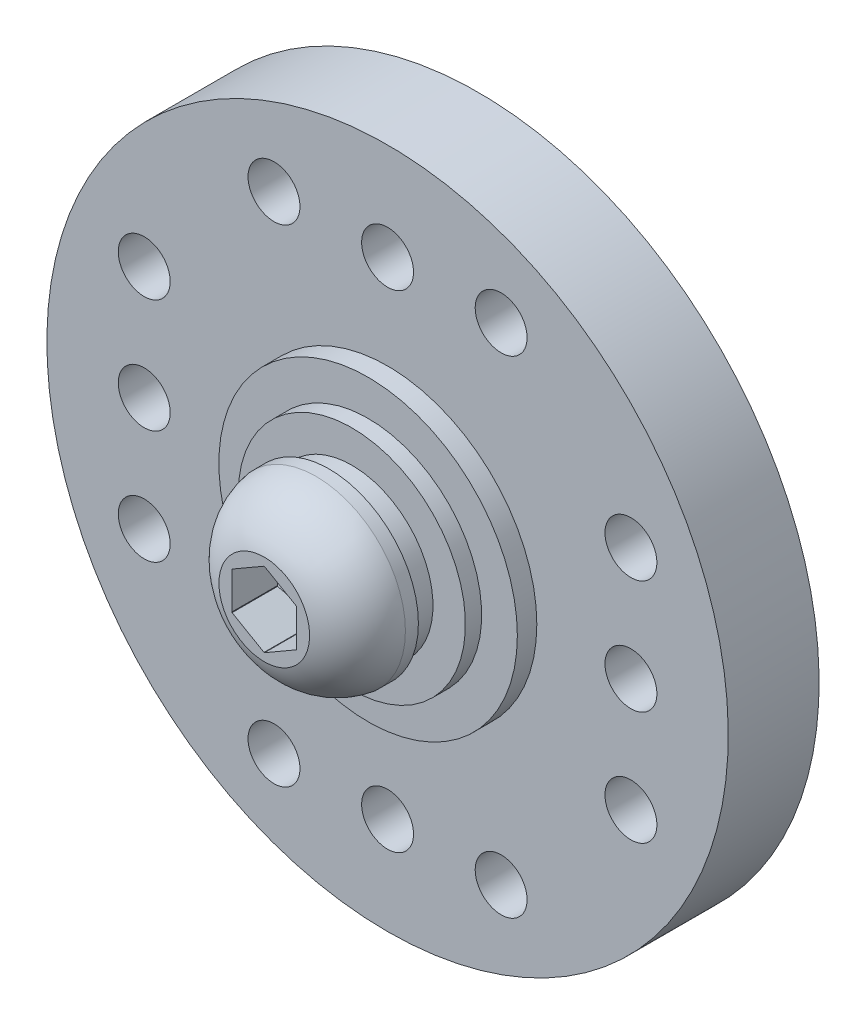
ISO-10303-21;
HEADER;
FILE_DESCRIPTION(('STEP AP214'),'2;1');
FILE_NAME('part.step','',(''),(''),'','','');
FILE_SCHEMA(('AUTOMOTIVE_DESIGN { 1 0 10303 214 1 1 1 1 }'));
ENDSEC;
DATA;
#1=APPLICATION_CONTEXT('core data for automotive mechanical design processes');
#2=APPLICATION_PROTOCOL_DEFINITION('international standard','automotive_design',2000,#1);
#3=PRODUCT_CONTEXT('',#1,'mechanical');
#4=PRODUCT('Part','Part','',(#3));
#5=PRODUCT_RELATED_PRODUCT_CATEGORY('part','',(#4));
#6=PRODUCT_DEFINITION_FORMATION('','',#4);
#7=PRODUCT_DEFINITION_CONTEXT('part definition',#1,'design');
#8=PRODUCT_DEFINITION('design','',#6,#7);
#9=PRODUCT_DEFINITION_SHAPE('','',#8);
#10=(LENGTH_UNIT() NAMED_UNIT(*) SI_UNIT(.MILLI.,.METRE.));
#11=(NAMED_UNIT(*) PLANE_ANGLE_UNIT() SI_UNIT($,.RADIAN.));
#12=(NAMED_UNIT(*) SI_UNIT($,.STERADIAN.) SOLID_ANGLE_UNIT());
#13=UNCERTAINTY_MEASURE_WITH_UNIT(LENGTH_MEASURE(1.E-05),#10,'distance_accuracy_value','');
#14=(GEOMETRIC_REPRESENTATION_CONTEXT(3) GLOBAL_UNCERTAINTY_ASSIGNED_CONTEXT((#13)) GLOBAL_UNIT_ASSIGNED_CONTEXT((#10,
#11,#12)) REPRESENTATION_CONTEXT('',''));
#15=CARTESIAN_POINT('',(0.,0.,0.));
#16=DIRECTION('',(0.,0.,1.));
#17=DIRECTION('',(1.,0.,0.));
#18=AXIS2_PLACEMENT_3D('',#15,#16,#17);
#19=CARTESIAN_POINT('',(1.0924914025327,-9.64850156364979,-6.2));
#20=DIRECTION('',(0.,0.,1.));
#21=DIRECTION('',(1.,0.,0.));
#22=AXIS2_PLACEMENT_3D('',#19,#20,#21);
#23=PLANE('',#22);
#24=CARTESIAN_POINT('',(0.,0.,-6.20000000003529));
#25=DIRECTION('',(0.,0.,1.));
#26=DIRECTION('',(1.,0.,0.));
#27=AXIS2_PLACEMENT_3D('',#24,#25,#26);
#28=CIRCLE('',#27,1.10000000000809);
#29=CARTESIAN_POINT('',(1.10000000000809,0.,-6.20000000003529));
#30=VERTEX_POINT('',#29);
#31=EDGE_CURVE('E78',#30,#30,#28,.T.);
#32=ORIENTED_EDGE('',*,*,#31,.F.);
#33=EDGE_LOOP('',(#32));
#34=FACE_BOUND('',#33,.T.);
#35=ADVANCED_FACE('F15',(#34),#23,.F.);
#36=CARTESIAN_POINT('',(-1.7295135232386,-1.10944255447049,1.8));
#37=DIRECTION('',(0.,0.,-1.));
#38=DIRECTION('',(-1.,0.,0.));
#39=AXIS2_PLACEMENT_3D('',#36,#37,#38);
#40=PLANE('',#39);
#41=CARTESIAN_POINT('',(0.,0.,1.79999999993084));
#42=DIRECTION('',(0.,0.,1.));
#43=DIRECTION('',(1.,0.,0.));
#44=AXIS2_PLACEMENT_3D('',#41,#42,#43);
#45=CIRCLE('',#44,0.110768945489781);
#46=CARTESIAN_POINT('',(0.110768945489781,0.,1.79999999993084));
#47=VERTEX_POINT('',#46);
#48=EDGE_CURVE('E480',#47,#47,#45,.T.);
#49=ORIENTED_EDGE('',*,*,#48,.T.);
#50=EDGE_LOOP('',(#49));
#51=FACE_BOUND('',#50,.T.);
#52=ADVANCED_FACE('F779',(#51),#40,.F.);
#53=CARTESIAN_POINT('',(0.,0.,-5.8000000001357));
#54=DIRECTION('',(0.,0.,1.));
#55=DIRECTION('',(1.,0.,0.));
#56=AXIS2_PLACEMENT_3D('',#53,#54,#55);
#57=CONICAL_SURFACE('',#56,1.49999999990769,0.785398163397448);
#58=ORIENTED_EDGE('',*,*,#31,.T.);
#59=EDGE_LOOP('',(#58));
#60=FACE_BOUND('',#59,.T.);
#61=CARTESIAN_POINT('',(0.,0.,-5.8));
#62=DIRECTION('',(0.,0.,1.));
#63=DIRECTION('',(1.,0.,0.));
#64=AXIS2_PLACEMENT_3D('',#61,#62,#63);
#65=CIRCLE('',#64,1.5);
#66=CARTESIAN_POINT('',(1.5,0.,-5.8));
#67=VERTEX_POINT('',#66);
#68=EDGE_CURVE('E109',#67,#67,#65,.T.);
#69=ORIENTED_EDGE('',*,*,#68,.F.);
#70=EDGE_LOOP('',(#69));
#71=FACE_BOUND('',#70,.T.);
#72=ADVANCED_FACE('F772',(#60,#71),#57,.T.);
#73=CARTESIAN_POINT('',(0.,0.,5.9709923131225));
#74=DIRECTION('',(0.,0.,1.));
#75=DIRECTION('',(1.,0.,0.));
#76=AXIS2_PLACEMENT_3D('',#73,#74,#75);
#77=CYLINDRICAL_SURFACE('',#76,1.15);
#78=CARTESIAN_POINT('',(0.,0.,3.8));
#79=DIRECTION('',(0.,0.,1.));
#80=DIRECTION('',(1.,0.,0.));
#81=AXIS2_PLACEMENT_3D('',#78,#79,#80);
#82=CIRCLE('',#81,1.15);
#83=CARTESIAN_POINT('',(-1.,0.56789083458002,3.8));
#84=VERTEX_POINT('',#83);
#85=CARTESIAN_POINT('',(-0.991807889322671,0.582079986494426,3.8));
#86=VERTEX_POINT('',#85);
#87=EDGE_CURVE('E68',#84,#86,#82,.F.);
#88=ORIENTED_EDGE('',*,*,#87,.F.);
#89=DIRECTION('',(0.,0.,-1.));
#90=VECTOR('',#89,1.);
#91=CARTESIAN_POINT('',(-1.,0.567890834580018,0.955452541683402));
#92=LINE('',#91,#90);
#93=CARTESIAN_POINT('',(-1.,0.567890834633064,2.4000003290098));
#94=VERTEX_POINT('',#93);
#95=EDGE_CURVE('E297',#94,#84,#92,.F.);
#96=ORIENTED_EDGE('',*,*,#95,.F.);
#97=CARTESIAN_POINT('',(0.,0.,2.40000032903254));
#98=DIRECTION('',(0.,0.,1.));
#99=DIRECTION('',(1.,0.,0.));
#100=AXIS2_PLACEMENT_3D('',#97,#98,#99);
#101=CIRCLE('',#100,1.15000000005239);
#102=CARTESIAN_POINT('',(-0.991807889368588,0.582079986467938,2.40000032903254));
#103=VERTEX_POINT('',#102);
#104=EDGE_CURVE('E86',#94,#103,#101,.F.);
#105=ORIENTED_EDGE('',*,*,#104,.T.);
#106=DIRECTION('',(0.,0.,1.));
#107=VECTOR('',#106,1.);
#108=CARTESIAN_POINT('',(-0.991807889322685,0.58207998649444,0.955452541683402));
#109=LINE('',#108,#107);
#110=EDGE_CURVE('E82',#86,#103,#109,.F.);
#111=ORIENTED_EDGE('',*,*,#110,.F.);
#112=EDGE_LOOP('',(#88,#96,#105,#111));
#113=FACE_BOUND('',#112,.T.);
#114=ADVANCED_FACE('F83',(#113),#77,.F.);
#115=CARTESIAN_POINT('',(0.,0.,5.9709923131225));
#116=DIRECTION('',(0.,0.,1.));
#117=DIRECTION('',(1.,0.,0.));
#118=AXIS2_PLACEMENT_3D('',#115,#116,#117);
#119=CYLINDRICAL_SURFACE('',#118,1.15);
#120=CARTESIAN_POINT('',(0.,0.,2.40000032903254));
#121=DIRECTION('',(0.,0.,1.));
#122=DIRECTION('',(1.,0.,0.));
#123=AXIS2_PLACEMENT_3D('',#120,#121,#122);
#124=CIRCLE('',#123,1.15000000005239);
#125=CARTESIAN_POINT('',(-0.00819211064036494,1.14997082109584,2.40000032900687));
#126=VERTEX_POINT('',#125);
#127=CARTESIAN_POINT('',(0.00819211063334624,1.14997082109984,2.40000032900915));
#128=VERTEX_POINT('',#127);
#129=EDGE_CURVE('E106',#126,#128,#124,.F.);
#130=ORIENTED_EDGE('',*,*,#129,.T.);
#131=DIRECTION('',(0.,0.,1.));
#132=VECTOR('',#131,1.);
#133=CARTESIAN_POINT('',(0.00819211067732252,1.14997082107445,0.955452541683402));
#134=LINE('',#133,#132);
#135=CARTESIAN_POINT('',(0.00819211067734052,1.14997082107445,3.8));
#136=VERTEX_POINT('',#135);
#137=EDGE_CURVE('E461',#136,#128,#134,.F.);
#138=ORIENTED_EDGE('',*,*,#137,.F.);
#139=CARTESIAN_POINT('',(0.,0.,3.8));
#140=DIRECTION('',(0.,0.,1.));
#141=DIRECTION('',(1.,0.,0.));
#142=AXIS2_PLACEMENT_3D('',#139,#140,#141);
#143=CIRCLE('',#142,1.15);
#144=CARTESIAN_POINT('',(-0.00819211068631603,1.14997082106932,3.8));
#145=VERTEX_POINT('',#144);
#146=EDGE_CURVE('E77',#145,#136,#143,.F.);
#147=ORIENTED_EDGE('',*,*,#146,.F.);
#148=DIRECTION('',(0.,0.,1.));
#149=VECTOR('',#148,1.);
#150=CARTESIAN_POINT('',(-0.00819211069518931,1.14997082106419,0.955452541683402));
#151=LINE('',#150,#149);
#152=EDGE_CURVE('E96',#126,#145,#151,.T.);
#153=ORIENTED_EDGE('',*,*,#152,.F.);
#154=EDGE_LOOP('',(#130,#138,#147,#153));
#155=FACE_BOUND('',#154,.T.);
#156=ADVANCED_FACE('F502',(#155),#119,.F.);
#157=CARTESIAN_POINT('',(0.,0.,5.9709923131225));
#158=DIRECTION('',(0.,0.,1.));
#159=DIRECTION('',(1.,0.,0.));
#160=AXIS2_PLACEMENT_3D('',#157,#158,#159);
#161=CYLINDRICAL_SURFACE('',#160,1.15);
#162=CARTESIAN_POINT('',(0.,0.,2.40000032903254));
#163=DIRECTION('',(0.,0.,1.));
#164=DIRECTION('',(1.,0.,0.));
#165=AXIS2_PLACEMENT_3D('',#162,#163,#164);
#166=CIRCLE('',#165,1.15000000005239);
#167=CARTESIAN_POINT('',(0.991807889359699,0.582079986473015,2.40000032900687));
#168=VERTEX_POINT('',#167);
#169=CARTESIAN_POINT('',(1.,0.567890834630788,2.40000032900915));
#170=VERTEX_POINT('',#169);
#171=EDGE_CURVE('E488',#168,#170,#166,.F.);
#172=ORIENTED_EDGE('',*,*,#171,.T.);
#173=DIRECTION('',(0.,0.,1.));
#174=VECTOR('',#173,1.);
#175=CARTESIAN_POINT('',(1.,0.567890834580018,0.955452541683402));
#176=LINE('',#175,#174);
#177=CARTESIAN_POINT('',(1.,0.56789083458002,3.8));
#178=VERTEX_POINT('',#177);
#179=EDGE_CURVE('E458',#178,#170,#176,.F.);
#180=ORIENTED_EDGE('',*,*,#179,.F.);
#181=CARTESIAN_POINT('',(0.,0.,3.8));
#182=DIRECTION('',(0.,0.,1.));
#183=DIRECTION('',(1.,0.,0.));
#184=AXIS2_PLACEMENT_3D('',#181,#182,#183);
#185=CIRCLE('',#184,1.15);
#186=CARTESIAN_POINT('',(0.991807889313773,0.582079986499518,3.8));
#187=VERTEX_POINT('',#186);
#188=EDGE_CURVE('E107',#187,#178,#185,.F.);
#189=ORIENTED_EDGE('',*,*,#188,.F.);
#190=DIRECTION('',(0.,0.,1.));
#191=VECTOR('',#190,1.);
#192=CARTESIAN_POINT('',(0.991807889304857,0.582079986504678,0.955452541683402));
#193=LINE('',#192,#191);
#194=EDGE_CURVE('E464',#168,#187,#193,.T.);
#195=ORIENTED_EDGE('',*,*,#194,.F.);
#196=EDGE_LOOP('',(#172,#180,#189,#195));
#197=FACE_BOUND('',#196,.T.);
#198=ADVANCED_FACE('F754',(#197),#161,.F.);
#199=CARTESIAN_POINT('',(0.,0.,5.9709923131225));
#200=DIRECTION('',(0.,0.,1.));
#201=DIRECTION('',(1.,0.,0.));
#202=AXIS2_PLACEMENT_3D('',#199,#200,#201);
#203=CYLINDRICAL_SURFACE('',#202,1.15);
#204=CARTESIAN_POINT('',(0.,0.,2.40000032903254));
#205=DIRECTION('',(0.,0.,1.));
#206=DIRECTION('',(1.,0.,0.));
#207=AXIS2_PLACEMENT_3D('',#204,#205,#206);
#208=CIRCLE('',#207,1.15000000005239);
#209=CARTESIAN_POINT('',(1.,-0.567890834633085,2.4000003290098));
#210=VERTEX_POINT('',#209);
#211=CARTESIAN_POINT('',(0.991807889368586,-0.582079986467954,2.40000032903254));
#212=VERTEX_POINT('',#211);
#213=EDGE_CURVE('E482',#210,#212,#208,.F.);
#214=ORIENTED_EDGE('',*,*,#213,.T.);
#215=DIRECTION('',(0.,0.,1.));
#216=VECTOR('',#215,1.);
#217=CARTESIAN_POINT('',(0.991807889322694,-0.58207998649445,0.955452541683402));
#218=LINE('',#217,#216);
#219=CARTESIAN_POINT('',(0.991807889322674,-0.582079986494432,3.8));
#220=VERTEX_POINT('',#219);
#221=EDGE_CURVE('E452',#220,#212,#218,.F.);
#222=ORIENTED_EDGE('',*,*,#221,.F.);
#223=CARTESIAN_POINT('',(0.,0.,3.8));
#224=DIRECTION('',(0.,0.,1.));
#225=DIRECTION('',(1.,0.,0.));
#226=AXIS2_PLACEMENT_3D('',#223,#224,#225);
#227=CIRCLE('',#226,1.15);
#228=CARTESIAN_POINT('',(1.,-0.567890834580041,3.8));
#229=VERTEX_POINT('',#228);
#230=EDGE_CURVE('E485',#229,#220,#227,.F.);
#231=ORIENTED_EDGE('',*,*,#230,.F.);
#232=DIRECTION('',(0.,0.,1.));
#233=VECTOR('',#232,1.);
#234=CARTESIAN_POINT('',(1.,-0.567890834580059,0.955452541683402));
#235=LINE('',#234,#233);
#236=EDGE_CURVE('E455',#210,#229,#235,.T.);
#237=ORIENTED_EDGE('',*,*,#236,.F.);
#238=EDGE_LOOP('',(#214,#222,#231,#237));
#239=FACE_BOUND('',#238,.T.);
#240=ADVANCED_FACE('F265',(#239),#203,.F.);
#241=CARTESIAN_POINT('',(0.,0.,2.40000032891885));
#242=DIRECTION('',(0.,0.,1.));
#243=DIRECTION('',(1.,0.,0.));
#244=AXIS2_PLACEMENT_3D('',#241,#242,#243);
#245=CONICAL_SURFACE('',#244,1.14999999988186,1.04719755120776);
#246=CARTESIAN_POINT('',(1.00000000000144,0.567890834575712,2.40000032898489));
#247=CARTESIAN_POINT('',(1.00000000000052,0.521258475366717,2.38670283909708));
#248=CARTESIAN_POINT('',(1.00000000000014,0.474263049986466,2.37454249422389));
#249=CARTESIAN_POINT('',(0.999999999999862,0.379528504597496,2.35306837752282));
#250=CARTESIAN_POINT('',(0.999999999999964,0.331788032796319,2.34376062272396));
#251=CARTESIAN_POINT('',(1.00000000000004,0.236828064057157,2.32879585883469));
#252=CARTESIAN_POINT('',(1.00000000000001,0.189621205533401,2.32306104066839));
#253=CARTESIAN_POINT('',(0.999999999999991,0.0949426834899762,2.31536393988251));
#254=CARTESIAN_POINT('',(0.999999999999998,0.0474713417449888,2.31339778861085));
#255=CARTESIAN_POINT('',(1.,-0.0474713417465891,2.31339778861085));
#256=CARTESIAN_POINT('',(1.,-0.0949426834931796,2.31536393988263));
#257=CARTESIAN_POINT('',(1.,-0.189621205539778,2.32306104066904));
#258=CARTESIAN_POINT('',(1.,-0.236828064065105,2.32879585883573));
#259=CARTESIAN_POINT('',(1.,-0.331788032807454,2.34376062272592));
#260=CARTESIAN_POINT('',(1.,-0.379528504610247,2.35306837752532));
#261=CARTESIAN_POINT('',(1.,-0.474263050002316,2.37454249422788));
#262=CARTESIAN_POINT('',(1.,-0.521258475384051,2.38670283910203));
#263=CARTESIAN_POINT('',(1.,-0.567890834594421,2.40000032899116));
#264=B_SPLINE_CURVE_WITH_KNOTS('',3,(#246,#247,#248,#249,#250,#251,#252,#253,#254,#255,#256,
#257,#258,#259,#260,#261,#262,#263),.UNSPECIFIED.,.F.,.F.,(4,2,2,2,2,2,2,2,4),(0.,
0.145515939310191,0.291336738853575,0.433859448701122,0.576235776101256,0.71861210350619,
0.86113481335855,1.00695561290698,1.15247155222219),.UNSPECIFIED.);
#265=EDGE_CURVE('E271',#170,#210,#264,.T.);
#266=ORIENTED_EDGE('',*,*,#265,.F.);
#267=ORIENTED_EDGE('',*,*,#171,.F.);
#268=CARTESIAN_POINT('',(0.00819211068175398,1.14997082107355,2.4000003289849));
#269=CARTESIAN_POINT('',(0.0519987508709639,1.12467904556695,2.38557261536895));
#270=CARTESIAN_POINT('',(0.0961837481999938,1.09916882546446,2.37248567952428));
#271=CARTESIAN_POINT('',(0.185307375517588,1.04771327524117,2.34972135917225));
#272=CARTESIAN_POINT('',(0.230247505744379,1.02176707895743,2.34005188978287));
#273=CARTESIAN_POINT('',(0.319574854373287,0.970193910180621,2.32510804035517));
#274=CARTESIAN_POINT('',(0.363948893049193,0.944574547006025,2.3197323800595));
#275=CARTESIAN_POINT('',(0.452889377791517,0.893224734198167,2.31350160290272));
#276=CARTESIAN_POINT('',(0.4974555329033,0.86749445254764,2.31264112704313));
#277=CARTESIAN_POINT('',(0.579654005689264,0.820037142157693,2.3152895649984));
#278=CARTESIAN_POINT('',(0.617303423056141,0.798300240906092,2.31814978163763));
#279=CARTESIAN_POINT('',(0.692333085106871,0.754981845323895,2.32695179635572));
#280=CARTESIAN_POINT('',(0.729713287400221,0.733400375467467,2.33289406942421));
#281=CARTESIAN_POINT('',(0.804866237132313,0.69001079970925,2.34764801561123));
#282=CARTESIAN_POINT('',(0.842630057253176,0.668207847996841,2.35651882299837));
#283=CARTESIAN_POINT('',(0.917617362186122,0.624913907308,2.37661214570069));
#284=CARTESIAN_POINT('',(0.954841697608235,0.603422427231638,2.3878303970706));
#285=CARTESIAN_POINT('',(0.99180788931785,0.582079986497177,2.40000032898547));
#286=B_SPLINE_CURVE_WITH_KNOTS('',3,(#268,#269,#270,#271,#272,#273,#274,#275,#276,#277,#278,
#279,#280,#281,#282,#283,#284,#285),.UNSPECIFIED.,.F.,.F.,(4,2,2,2,2,2,2,2,4),(0.,
0.157864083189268,0.31609143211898,0.470466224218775,0.624657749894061,0.755245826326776,
0.885854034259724,1.01927976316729,1.15246520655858),.UNSPECIFIED.);
#287=EDGE_CURVE('E279',#128,#168,#286,.T.);
#288=ORIENTED_EDGE('',*,*,#287,.F.);
#289=ORIENTED_EDGE('',*,*,#129,.F.);
#290=CARTESIAN_POINT('',(-0.991807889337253,0.582079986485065,2.40000032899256));
#291=CARTESIAN_POINT('',(-0.948001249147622,0.60737176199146,2.38557261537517));
#292=CARTESIAN_POINT('',(-0.903816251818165,0.632881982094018,2.37248567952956));
#293=CARTESIAN_POINT('',(-0.814692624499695,0.684337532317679,2.34972135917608));
#294=CARTESIAN_POINT('',(-0.769752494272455,0.710283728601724,2.34005188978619));
#295=CARTESIAN_POINT('',(-0.680425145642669,0.761856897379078,2.3251080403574));
#296=CARTESIAN_POINT('',(-0.636051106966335,0.787476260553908,2.31973238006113));
#297=CARTESIAN_POINT('',(-0.547110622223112,0.838826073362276,2.31350160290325));
#298=CARTESIAN_POINT('',(-0.502544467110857,0.864556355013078,2.31264112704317));
#299=CARTESIAN_POINT('',(-0.420345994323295,0.91201366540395,2.31528956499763));
#300=CARTESIAN_POINT('',(-0.382696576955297,0.933750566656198,2.3181497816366));
#301=CARTESIAN_POINT('',(-0.307666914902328,0.977068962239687,2.32695179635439));
#302=CARTESIAN_POINT('',(-0.270286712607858,0.998650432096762,2.33289406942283));
#303=CARTESIAN_POINT('',(-0.195133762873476,1.0420400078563,2.34764801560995));
#304=CARTESIAN_POINT('',(-0.157369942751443,1.06384295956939,2.35651882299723));
#305=CARTESIAN_POINT('',(-0.0823826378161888,1.10713690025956,2.37661214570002));
#306=CARTESIAN_POINT('',(-0.0451583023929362,1.12862838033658,2.38783039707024));
#307=CARTESIAN_POINT('',(-0.00819211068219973,1.14997082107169,2.40000032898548));
#308=B_SPLINE_CURVE_WITH_KNOTS('',3,(#290,#291,#292,#293,#294,#295,#296,#297,#298,#299,#300,
#301,#302,#303,#304,#305,#306,#307),.UNSPECIFIED.,.F.,.F.,(4,2,2,2,2,2,2,2,4),(0.,
0.157864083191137,0.31609143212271,0.470466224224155,0.624657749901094,0.75524582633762,
0.885854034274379,1.019279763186,1.15246520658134),.UNSPECIFIED.);
#309=EDGE_CURVE('E90',#103,#126,#308,.T.);
#310=ORIENTED_EDGE('',*,*,#309,.F.);
#311=ORIENTED_EDGE('',*,*,#104,.F.);
#312=CARTESIAN_POINT('',(-0.999999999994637,-0.567890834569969,2.40000032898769));
#313=CARTESIAN_POINT('',(-0.999999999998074,-0.521258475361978,2.38670283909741));
#314=CARTESIAN_POINT('',(-0.999999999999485,-0.474263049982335,2.3745424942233));
#315=CARTESIAN_POINT('',(-1.00000000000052,-0.379528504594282,2.35306837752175));
#316=CARTESIAN_POINT('',(-1.00000000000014,-0.331788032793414,2.34376062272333));
#317=CARTESIAN_POINT('',(-0.999999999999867,-0.236828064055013,2.32879585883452));
#318=CARTESIAN_POINT('',(-0.999999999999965,-0.189621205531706,2.32306104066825));
#319=CARTESIAN_POINT('',(-1.00000000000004,-0.0949426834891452,2.31536393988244));
#320=CARTESIAN_POINT('',(-1.00000000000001,-0.0474713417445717,2.31339778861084));
#321=CARTESIAN_POINT('',(-0.999999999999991,0.0474713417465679,2.31339778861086));
#322=CARTESIAN_POINT('',(-0.999999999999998,0.094942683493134,2.31536393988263));
#323=CARTESIAN_POINT('',(-1.,0.189621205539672,2.32306104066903));
#324=CARTESIAN_POINT('',(-1.,0.236828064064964,2.32879585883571));
#325=CARTESIAN_POINT('',(-1.,0.331788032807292,2.34376062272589));
#326=CARTESIAN_POINT('',(-1.,0.379528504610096,2.35306837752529));
#327=CARTESIAN_POINT('',(-1.,0.474263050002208,2.37454249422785));
#328=CARTESIAN_POINT('',(-1.,0.521258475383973,2.38670283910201));
#329=CARTESIAN_POINT('',(-1.,0.567890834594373,2.40000032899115));
#330=B_SPLINE_CURVE_WITH_KNOTS('',3,(#312,#313,#314,#315,#316,#317,#318,#319,#320,#321,#322,
#323,#324,#325,#326,#327,#328,#329),.UNSPECIFIED.,.F.,.F.,(4,2,2,2,2,2,2,2,4),(0.,
0.145515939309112,0.291336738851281,0.433859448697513,0.576235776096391,0.718612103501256,
0.861134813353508,1.00695561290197,1.15247155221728),.UNSPECIFIED.);
#331=CARTESIAN_POINT('',(-1.,-0.567890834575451,2.40000032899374));
#332=VERTEX_POINT('',#331);
#333=EDGE_CURVE('E111',#332,#94,#330,.T.);
#334=ORIENTED_EDGE('',*,*,#333,.F.);
#335=CARTESIAN_POINT('',(0.,0.,2.40000032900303));
#336=DIRECTION('',(0.,0.,1.));
#337=DIRECTION('',(1.,0.,0.));
#338=AXIS2_PLACEMENT_3D('',#335,#336,#337);
#339=CIRCLE('',#338,1.15);
#340=CARTESIAN_POINT('',(-0.991807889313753,-0.582079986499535,2.40000032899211));
#341=VERTEX_POINT('',#340);
#342=EDGE_CURVE('E477',#332,#341,#339,.T.);
#343=ORIENTED_EDGE('',*,*,#342,.T.);
#344=CARTESIAN_POINT('',(-0.00819211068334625,-1.14997082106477,2.40000032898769));
#345=CARTESIAN_POINT('',(-0.0519987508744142,-1.12467904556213,2.38557261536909));
#346=CARTESIAN_POINT('',(-0.0961837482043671,-1.09916882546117,2.37248567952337));
#347=CARTESIAN_POINT('',(-0.185307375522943,-1.04771327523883,2.34972135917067));
#348=CARTESIAN_POINT('',(-0.230247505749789,-1.0217670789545,2.34005188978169));
#349=CARTESIAN_POINT('',(-0.319574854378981,-0.970193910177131,2.32510804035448));
#350=CARTESIAN_POINT('',(-0.363948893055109,-0.944574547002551,2.3197323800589));
#351=CARTESIAN_POINT('',(-0.452889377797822,-0.893224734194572,2.31350160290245));
#352=CARTESIAN_POINT('',(-0.497455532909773,-0.867494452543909,2.3126411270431));
#353=CARTESIAN_POINT('',(-0.579654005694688,-0.820037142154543,2.31528956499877));
#354=CARTESIAN_POINT('',(-0.617303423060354,-0.79830024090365,2.31814978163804));
#355=CARTESIAN_POINT('',(-0.692333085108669,-0.754981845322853,2.32695179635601));
#356=CARTESIAN_POINT('',(-0.729713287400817,-0.733400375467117,2.33289406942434));
#357=CARTESIAN_POINT('',(-0.804866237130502,-0.690010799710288,2.34764801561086));
#358=CARTESIAN_POINT('',(-0.842630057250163,-0.668207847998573,2.35651882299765));
#359=CARTESIAN_POINT('',(-0.917617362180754,-0.624913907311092,2.37661214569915));
#360=CARTESIAN_POINT('',(-0.954841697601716,-0.603422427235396,2.3878303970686));
#361=CARTESIAN_POINT('',(-0.991807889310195,-0.582079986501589,2.40000032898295));
#362=B_SPLINE_CURVE_WITH_KNOTS('',3,(#344,#345,#346,#347,#348,#349,#350,#351,#352,#353,#354,
#355,#356,#357,#358,#359,#360,#361),.UNSPECIFIED.,.F.,.F.,(4,2,2,2,2,2,2,2,4),(0.,
0.157864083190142,0.316091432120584,0.470466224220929,0.624657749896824,0.755245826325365,
0.88585403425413,1.01927976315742,1.1524652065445),.UNSPECIFIED.);
#363=CARTESIAN_POINT('',(-0.00819211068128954,-1.14997082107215,2.40000032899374));
#364=VERTEX_POINT('',#363);
#365=EDGE_CURVE('E240',#364,#341,#362,.T.);
#366=ORIENTED_EDGE('',*,*,#365,.F.);
#367=CARTESIAN_POINT('',(0.,0.,2.40000032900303));
#368=DIRECTION('',(0.,0.,1.));
#369=DIRECTION('',(1.,0.,0.));
#370=AXIS2_PLACEMENT_3D('',#367,#368,#369);
#371=CIRCLE('',#370,1.15);
#372=CARTESIAN_POINT('',(0.00819211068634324,-1.14997082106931,2.40000032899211));
#373=VERTEX_POINT('',#372);
#374=EDGE_CURVE('E471',#364,#373,#371,.T.);
#375=ORIENTED_EDGE('',*,*,#374,.T.);
#376=CARTESIAN_POINT('',(0.991807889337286,-0.582079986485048,2.40000032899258));
#377=CARTESIAN_POINT('',(0.94800124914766,-0.607371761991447,2.38557261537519));
#378=CARTESIAN_POINT('',(0.903816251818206,-0.632881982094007,2.37248567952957));
#379=CARTESIAN_POINT('',(0.81469262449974,-0.684337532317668,2.34972135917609));
#380=CARTESIAN_POINT('',(0.769752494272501,-0.710283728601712,2.34005188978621));
#381=CARTESIAN_POINT('',(0.680425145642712,-0.761856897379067,2.32510804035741));
#382=CARTESIAN_POINT('',(0.636051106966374,-0.787476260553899,2.31973238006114));
#383=CARTESIAN_POINT('',(0.547110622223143,-0.838826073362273,2.31350160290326));
#384=CARTESIAN_POINT('',(0.502544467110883,-0.864556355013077,2.31264112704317));
#385=CARTESIAN_POINT('',(0.420345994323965,-0.912013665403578,2.31528956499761));
#386=CARTESIAN_POINT('',(0.382696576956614,-0.933750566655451,2.3181497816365));
#387=CARTESIAN_POINT('',(0.307666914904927,-0.9770689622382,2.32695179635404));
#388=CARTESIAN_POINT('',(0.270286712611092,-0.998650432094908,2.3328940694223));
#389=CARTESIAN_POINT('',(0.195133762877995,-1.04204000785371,2.34764801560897));
#390=CARTESIAN_POINT('',(0.157369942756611,-1.06384295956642,2.35651882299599));
#391=CARTESIAN_POINT('',(0.082382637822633,-1.10713690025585,2.37661214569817));
#392=CARTESIAN_POINT('',(0.0451583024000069,-1.12862838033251,2.38783039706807));
#393=CARTESIAN_POINT('',(0.00819211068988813,-1.14997082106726,2.40000032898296));
#394=B_SPLINE_CURVE_WITH_KNOTS('',3,(#376,#377,#378,#379,#380,#381,#382,#383,#384,#385,#386,
#387,#388,#389,#390,#391,#392,#393),.UNSPECIFIED.,.F.,.F.,(4,2,2,2,2,2,2,2,4),(0.,
0.157864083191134,0.316091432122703,0.470466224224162,0.624657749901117,0.755245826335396,
0.885854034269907,1.01927976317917,1.15246520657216),.UNSPECIFIED.);
#395=EDGE_CURVE('E250',#212,#373,#394,.T.);
#396=ORIENTED_EDGE('',*,*,#395,.F.);
#397=ORIENTED_EDGE('',*,*,#213,.F.);
#398=EDGE_LOOP('',(#266,#267,#288,#289,#310,#311,#334,#343,#366,#375,#396,#397));
#399=FACE_BOUND('',#398,.T.);
#400=ORIENTED_EDGE('',*,*,#48,.F.);
#401=EDGE_LOOP('',(#400));
#402=FACE_BOUND('',#401,.T.);
#403=ADVANCED_FACE('F259',(#399,#402),#245,.F.);
#404=CARTESIAN_POINT('',(0.,0.,5.9709923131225));
#405=DIRECTION('',(0.,0.,1.));
#406=DIRECTION('',(1.,0.,0.));
#407=AXIS2_PLACEMENT_3D('',#404,#405,#406);
#408=CYLINDRICAL_SURFACE('',#407,1.15);
#409=CARTESIAN_POINT('',(0.,0.,3.8));
#410=DIRECTION('',(0.,0.,1.));
#411=DIRECTION('',(1.,0.,0.));
#412=AXIS2_PLACEMENT_3D('',#409,#410,#411);
#413=CIRCLE('',#412,1.15);
#414=CARTESIAN_POINT('',(-0.991807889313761,-0.582079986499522,3.8));
#415=VERTEX_POINT('',#414);
#416=CARTESIAN_POINT('',(-1.,-0.567890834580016,3.8));
#417=VERTEX_POINT('',#416);
#418=EDGE_CURVE('E474',#415,#417,#413,.F.);
#419=ORIENTED_EDGE('',*,*,#418,.F.);
#420=DIRECTION('',(0.,0.,1.));
#421=VECTOR('',#420,1.);
#422=CARTESIAN_POINT('',(-0.991807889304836,-0.582079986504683,0.955452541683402));
#423=LINE('',#422,#421);
#424=EDGE_CURVE('E248',#341,#415,#423,.T.);
#425=ORIENTED_EDGE('',*,*,#424,.F.);
#426=ORIENTED_EDGE('',*,*,#342,.F.);
#427=DIRECTION('',(0.,0.,-1.));
#428=VECTOR('',#427,1.);
#429=CARTESIAN_POINT('',(-1.,-0.567890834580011,0.955452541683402));
#430=LINE('',#429,#428);
#431=EDGE_CURVE('E91',#417,#332,#430,.T.);
#432=ORIENTED_EDGE('',*,*,#431,.F.);
#433=EDGE_LOOP('',(#419,#425,#426,#432));
#434=FACE_BOUND('',#433,.T.);
#435=ADVANCED_FACE('F264',(#434),#408,.F.);
#436=CARTESIAN_POINT('',(0.,0.,5.9709923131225));
#437=DIRECTION('',(0.,0.,1.));
#438=DIRECTION('',(1.,0.,0.));
#439=AXIS2_PLACEMENT_3D('',#436,#437,#438);
#440=CYLINDRICAL_SURFACE('',#439,1.15);
#441=CARTESIAN_POINT('',(0.,0.,3.8));
#442=DIRECTION('',(0.,0.,1.));
#443=DIRECTION('',(1.,0.,0.));
#444=AXIS2_PLACEMENT_3D('',#441,#442,#443);
#445=CIRCLE('',#444,1.15);
#446=CARTESIAN_POINT('',(0.00819211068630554,-1.1499708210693,3.8));
#447=VERTEX_POINT('',#446);
#448=CARTESIAN_POINT('',(-0.00819211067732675,-1.14997082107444,3.8));
#449=VERTEX_POINT('',#448);
#450=EDGE_CURVE('E33',#447,#449,#445,.F.);
#451=ORIENTED_EDGE('',*,*,#450,.F.);
#452=DIRECTION('',(0.,0.,1.));
#453=VECTOR('',#452,1.);
#454=CARTESIAN_POINT('',(0.00819211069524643,-1.14997082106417,0.955452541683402));
#455=LINE('',#454,#453);
#456=EDGE_CURVE('E249',#373,#447,#455,.T.);
#457=ORIENTED_EDGE('',*,*,#456,.F.);
#458=ORIENTED_EDGE('',*,*,#374,.F.);
#459=DIRECTION('',(0.,0.,1.));
#460=VECTOR('',#459,1.);
#461=CARTESIAN_POINT('',(-0.00819211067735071,-1.14997082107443,0.955452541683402));
#462=LINE('',#461,#460);
#463=EDGE_CURVE('E239',#449,#364,#462,.F.);
#464=ORIENTED_EDGE('',*,*,#463,.F.);
#465=EDGE_LOOP('',(#451,#457,#458,#464));
#466=FACE_BOUND('',#465,.T.);
#467=ADVANCED_FACE('F307',(#466),#440,.F.);
#468=CARTESIAN_POINT('',(0.,0.,1.8));
#469=DIRECTION('',(0.,0.,1.));
#470=DIRECTION('',(1.,0.,0.));
#471=AXIS2_PLACEMENT_3D('',#468,#469,#470);
#472=CYLINDRICAL_SURFACE('',#471,1.5);
#473=ORIENTED_EDGE('',*,*,#68,.T.);
#474=EDGE_LOOP('',(#473));
#475=FACE_BOUND('',#474,.T.);
#476=CARTESIAN_POINT('',(0.,0.,0.600000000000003));
#477=DIRECTION('',(0.,0.,1.));
#478=DIRECTION('',(1.,0.,0.));
#479=AXIS2_PLACEMENT_3D('',#476,#477,#478);
#480=CIRCLE('',#479,1.5);
#481=CARTESIAN_POINT('',(1.5,0.,0.600000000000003));
#482=VERTEX_POINT('',#481);
#483=EDGE_CURVE('E102',#482,#482,#480,.T.);
#484=ORIENTED_EDGE('',*,*,#483,.F.);
#485=EDGE_LOOP('',(#484));
#486=FACE_BOUND('',#485,.T.);
#487=ADVANCED_FACE('F303',(#475,#486),#472,.T.);
#488=CARTESIAN_POINT('',(-1.,0.577350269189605,0.955452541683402));
#489=DIRECTION('',(1.,0.,0.));
#490=DIRECTION('',(0.,0.,-1.));
#491=AXIS2_PLACEMENT_3D('',#488,#489,#490);
#492=PLANE('',#491);
#493=DIRECTION('',(0.,1.,0.));
#494=VECTOR('',#493,1.);
#495=CARTESIAN_POINT('',(-1.,0.6783928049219,3.8));
#496=LINE('',#495,#494);
#497=EDGE_CURVE('E76',#417,#84,#496,.T.);
#498=ORIENTED_EDGE('',*,*,#497,.F.);
#499=ORIENTED_EDGE('',*,*,#431,.T.);
#500=ORIENTED_EDGE('',*,*,#333,.T.);
#501=ORIENTED_EDGE('',*,*,#95,.T.);
#502=EDGE_LOOP('',(#498,#499,#500,#501));
#503=FACE_BOUND('',#502,.T.);
#504=ADVANCED_FACE('F299',(#503),#492,.T.);
#505=CARTESIAN_POINT('',(-0.732050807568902,0.732050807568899,0.955452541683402));
#506=DIRECTION('',(0.5,-0.866025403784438,0.));
#507=DIRECTION('',(0.866025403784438,0.5,0.));
#508=AXIS2_PLACEMENT_3D('',#505,#506,#507);
#509=PLANE('',#508);
#510=ORIENTED_EDGE('',*,*,#152,.T.);
#511=DIRECTION('',(0.866025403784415,0.500000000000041,0.));
#512=VECTOR('',#511,1.);
#513=CARTESIAN_POINT('',(-0.991807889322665,0.582079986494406,3.8));
#514=LINE('',#513,#512);
#515=EDGE_CURVE('E74',#86,#145,#514,.T.);
#516=ORIENTED_EDGE('',*,*,#515,.F.);
#517=ORIENTED_EDGE('',*,*,#110,.T.);
#518=ORIENTED_EDGE('',*,*,#309,.T.);
#519=EDGE_LOOP('',(#510,#516,#517,#518));
#520=FACE_BOUND('',#519,.T.);
#521=ADVANCED_FACE('F94',(#520),#509,.T.);
#522=CARTESIAN_POINT('',(1.,0.577350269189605,0.955452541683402));
#523=DIRECTION('',(-0.5,-0.866025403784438,0.));
#524=DIRECTION('',(0.866025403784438,-0.5,0.));
#525=AXIS2_PLACEMENT_3D('',#522,#523,#524);
#526=PLANE('',#525);
#527=DIRECTION('',(0.86602540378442,-0.500000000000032,0.));
#528=VECTOR('',#527,1.);
#529=CARTESIAN_POINT('',(0.0081921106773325,1.14997082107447,3.8));
#530=LINE('',#529,#528);
#531=EDGE_CURVE('E97',#136,#187,#530,.T.);
#532=ORIENTED_EDGE('',*,*,#531,.F.);
#533=ORIENTED_EDGE('',*,*,#137,.T.);
#534=ORIENTED_EDGE('',*,*,#287,.T.);
#535=ORIENTED_EDGE('',*,*,#194,.T.);
#536=EDGE_LOOP('',(#532,#533,#534,#535));
#537=FACE_BOUND('',#536,.T.);
#538=ADVANCED_FACE('F511',(#537),#526,.T.);
#539=CARTESIAN_POINT('',(1.,-0.577350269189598,0.955452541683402));
#540=DIRECTION('',(-1.,0.,0.));
#541=DIRECTION('',(0.,0.,1.));
#542=AXIS2_PLACEMENT_3D('',#539,#540,#541);
#543=PLANE('',#542);
#544=ORIENTED_EDGE('',*,*,#265,.T.);
#545=ORIENTED_EDGE('',*,*,#236,.T.);
#546=DIRECTION('',(0.,1.,0.));
#547=VECTOR('',#546,1.);
#548=CARTESIAN_POINT('',(1.,0.6783928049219,3.8));
#549=LINE('',#548,#547);
#550=EDGE_CURVE('E100',#178,#229,#549,.F.);
#551=ORIENTED_EDGE('',*,*,#550,.F.);
#552=ORIENTED_EDGE('',*,*,#179,.T.);
#553=EDGE_LOOP('',(#544,#545,#551,#552));
#554=FACE_BOUND('',#553,.T.);
#555=ADVANCED_FACE('F713',(#554),#543,.T.);
#556=CARTESIAN_POINT('',(0.,-1.1547005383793,0.955452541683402));
#557=DIRECTION('',(-0.5,0.866025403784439,0.));
#558=DIRECTION('',(-0.866025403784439,-0.5,0.));
#559=AXIS2_PLACEMENT_3D('',#556,#557,#558);
#560=PLANE('',#559);
#561=ORIENTED_EDGE('',*,*,#395,.T.);
#562=ORIENTED_EDGE('',*,*,#456,.T.);
#563=DIRECTION('',(-0.866025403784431,-0.500000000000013,0.));
#564=VECTOR('',#563,1.);
#565=CARTESIAN_POINT('',(0.991807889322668,-0.582079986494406,3.8));
#566=LINE('',#565,#564);
#567=EDGE_CURVE('E476',#220,#447,#566,.T.);
#568=ORIENTED_EDGE('',*,*,#567,.F.);
#569=ORIENTED_EDGE('',*,*,#221,.T.);
#570=EDGE_LOOP('',(#561,#562,#568,#569));
#571=FACE_BOUND('',#570,.T.);
#572=ADVANCED_FACE('F706',(#571),#560,.T.);
#573=CARTESIAN_POINT('',(-1.,-0.577350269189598,0.955452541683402));
#574=DIRECTION('',(0.5,0.866025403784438,0.));
#575=DIRECTION('',(-0.866025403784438,0.5,0.));
#576=AXIS2_PLACEMENT_3D('',#573,#574,#575);
#577=PLANE('',#576);
#578=DIRECTION('',(-0.866025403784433,0.50000000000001,0.));
#579=VECTOR('',#578,1.);
#580=CARTESIAN_POINT('',(-0.00819211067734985,-1.14997082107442,3.8));
#581=LINE('',#580,#579);
#582=EDGE_CURVE('E236',#449,#415,#581,.T.);
#583=ORIENTED_EDGE('',*,*,#582,.F.);
#584=ORIENTED_EDGE('',*,*,#463,.T.);
#585=ORIENTED_EDGE('',*,*,#365,.T.);
#586=ORIENTED_EDGE('',*,*,#424,.T.);
#587=EDGE_LOOP('',(#583,#584,#585,#586));
#588=FACE_BOUND('',#587,.T.);
#589=ADVANCED_FACE('F256',(#588),#577,.T.);
#590=CARTESIAN_POINT('',(-0.533991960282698,-1.7992282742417,0.600000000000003));
#591=DIRECTION('',(0.,0.,-1.));
#592=DIRECTION('',(-1.,0.,0.));
#593=AXIS2_PLACEMENT_3D('',#590,#591,#592);
#594=PLANE('',#593);
#595=CARTESIAN_POINT('',(0.,0.,0.600000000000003));
#596=DIRECTION('',(0.,0.,1.));
#597=DIRECTION('',(1.,0.,0.));
#598=AXIS2_PLACEMENT_3D('',#595,#596,#597);
#599=CIRCLE('',#598,2.5);
#600=CARTESIAN_POINT('',(2.5,0.,0.600000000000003));
#601=VERTEX_POINT('',#600);
#602=EDGE_CURVE('E233',#601,#601,#599,.F.);
#603=ORIENTED_EDGE('',*,*,#602,.T.);
#604=EDGE_LOOP('',(#603));
#605=FACE_BOUND('',#604,.T.);
#606=ORIENTED_EDGE('',*,*,#483,.T.);
#607=EDGE_LOOP('',(#606));
#608=FACE_BOUND('',#607,.T.);
#609=ADVANCED_FACE('F693',(#605,#608),#594,.T.);
#610=CARTESIAN_POINT('',(-0.166657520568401,0.6783928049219,3.8));
#611=DIRECTION('',(0.,0.,1.));
#612=DIRECTION('',(1.,0.,0.));
#613=AXIS2_PLACEMENT_3D('',#610,#611,#612);
#614=PLANE('',#613);
#615=CARTESIAN_POINT('',(0.,0.,3.8));
#616=DIRECTION('',(0.,0.,-1.));
#617=DIRECTION('',(-1.,0.,0.));
#618=AXIS2_PLACEMENT_3D('',#615,#616,#617);
#619=CIRCLE('',#618,1.39712780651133);
#620=CARTESIAN_POINT('',(-1.39712780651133,0.,3.8));
#621=VERTEX_POINT('',#620);
#622=EDGE_CURVE('E230',#621,#621,#619,.T.);
#623=ORIENTED_EDGE('',*,*,#622,.F.);
#624=EDGE_LOOP('',(#623));
#625=FACE_BOUND('',#624,.T.);
#626=ORIENTED_EDGE('',*,*,#450,.T.);
#627=ORIENTED_EDGE('',*,*,#582,.T.);
#628=ORIENTED_EDGE('',*,*,#418,.T.);
#629=ORIENTED_EDGE('',*,*,#497,.T.);
#630=ORIENTED_EDGE('',*,*,#87,.T.);
#631=ORIENTED_EDGE('',*,*,#515,.T.);
#632=ORIENTED_EDGE('',*,*,#146,.T.);
#633=ORIENTED_EDGE('',*,*,#531,.T.);
#634=ORIENTED_EDGE('',*,*,#188,.T.);
#635=ORIENTED_EDGE('',*,*,#550,.T.);
#636=ORIENTED_EDGE('',*,*,#230,.T.);
#637=ORIENTED_EDGE('',*,*,#567,.T.);
#638=EDGE_LOOP('',(#626,#627,#628,#629,#630,#631,#632,#633,#634,#635,#636,#637));
#639=FACE_BOUND('',#638,.T.);
#640=ADVANCED_FACE('F72',(#625,#639),#614,.T.);
#641=CARTESIAN_POINT('',(0.,0.,0.600000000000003));
#642=DIRECTION('',(0.,0.,1.));
#643=DIRECTION('',(1.,0.,0.));
#644=AXIS2_PLACEMENT_3D('',#641,#642,#643);
#645=CYLINDRICAL_SURFACE('',#644,2.5);
#646=ORIENTED_EDGE('',*,*,#602,.F.);
#647=EDGE_LOOP('',(#646));
#648=FACE_BOUND('',#647,.T.);
#649=CARTESIAN_POINT('',(0.,0.,-3.4));
#650=DIRECTION('',(0.,0.,1.));
#651=DIRECTION('',(1.,0.,0.));
#652=AXIS2_PLACEMENT_3D('',#649,#650,#651);
#653=CIRCLE('',#652,2.5);
#654=CARTESIAN_POINT('',(2.5,0.,-3.4));
#655=VERTEX_POINT('',#654);
#656=EDGE_CURVE('E227',#655,#655,#653,.T.);
#657=ORIENTED_EDGE('',*,*,#656,.F.);
#658=EDGE_LOOP('',(#657));
#659=FACE_BOUND('',#658,.T.);
#660=ADVANCED_FACE('F440',(#648,#659),#645,.F.);
#661=CARTESIAN_POINT('',(-0.184327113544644,0.750318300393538,1.9));
#662=DIRECTION('',(0.971124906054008,0.238571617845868,0.));
#663=DIRECTION('',(-0.238571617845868,0.971124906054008,0.));
#664=AXIS2_PLACEMENT_3D('',#661,#662,#663);
#665=CIRCLE('',#664,2.);
#666=TRIMMED_CURVE('',#665,(PARAMETER_VALUE(-1.96742832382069)),
(PARAMETER_VALUE(1.96742832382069)),.T.,.PARAMETER.);
#667=CARTESIAN_POINT('',(0.,0.,1.9));
#668=DIRECTION('',(0.,0.,-1.));
#669=AXIS1_PLACEMENT('',#667,#668);
#670=SURFACE_OF_REVOLUTION('',#666,#669);
#671=CARTESIAN_POINT('',(0.,0.,2.2));
#672=DIRECTION('',(0.,0.,1.));
#673=DIRECTION('',(1.,0.,0.));
#674=AXIS2_PLACEMENT_3D('',#671,#672,#673);
#675=CIRCLE('',#674,2.75);
#676=CARTESIAN_POINT('',(2.75,0.,2.2));
#677=VERTEX_POINT('',#676);
#678=EDGE_CURVE('E226',#677,#677,#675,.F.);
#679=ORIENTED_EDGE('',*,*,#678,.F.);
#680=EDGE_LOOP('',(#679));
#681=FACE_BOUND('',#680,.T.);
#682=ORIENTED_EDGE('',*,*,#622,.T.);
#683=EDGE_LOOP('',(#682));
#684=FACE_BOUND('',#683,.T.);
#685=ADVANCED_FACE('F435',(#681,#684),#670,.F.);
#686=CARTESIAN_POINT('',(-0.375771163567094,0.0405353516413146,-3.4));
#687=DIRECTION('',(0.,0.,-1.));
#688=DIRECTION('',(-1.,0.,0.));
#689=AXIS2_PLACEMENT_3D('',#686,#687,#688);
#690=PLANE('',#689);
#691=CARTESIAN_POINT('',(0.,0.,-3.4));
#692=DIRECTION('',(0.,0.,1.));
#693=DIRECTION('',(1.,0.,0.));
#694=AXIS2_PLACEMENT_3D('',#691,#692,#693);
#695=CIRCLE('',#694,2.95);
#696=CARTESIAN_POINT('',(2.95,0.,-3.4));
#697=VERTEX_POINT('',#696);
#698=EDGE_CURVE('E223',#697,#697,#695,.T.);
#699=ORIENTED_EDGE('',*,*,#698,.F.);
#700=EDGE_LOOP('',(#699));
#701=FACE_BOUND('',#700,.T.);
#702=ORIENTED_EDGE('',*,*,#656,.T.);
#703=EDGE_LOOP('',(#702));
#704=FACE_BOUND('',#703,.T.);
#705=ADVANCED_FACE('F431',(#701,#704),#690,.T.);
#706=CARTESIAN_POINT('',(0.,0.,2.));
#707=DIRECTION('',(0.,0.,1.));
#708=DIRECTION('',(1.,0.,0.));
#709=AXIS2_PLACEMENT_3D('',#706,#707,#708);
#710=CYLINDRICAL_SURFACE('',#709,2.75);
#711=ORIENTED_EDGE('',*,*,#678,.T.);
#712=EDGE_LOOP('',(#711));
#713=FACE_BOUND('',#712,.T.);
#714=CARTESIAN_POINT('',(0.,0.,1.8));
#715=DIRECTION('',(0.,0.,1.));
#716=DIRECTION('',(1.,0.,0.));
#717=AXIS2_PLACEMENT_3D('',#714,#715,#716);
#718=CIRCLE('',#717,2.75);
#719=CARTESIAN_POINT('',(2.75,0.,1.8));
#720=VERTEX_POINT('',#719);
#721=EDGE_CURVE('E220',#720,#720,#718,.F.);
#722=ORIENTED_EDGE('',*,*,#721,.F.);
#723=EDGE_LOOP('',(#722));
#724=FACE_BOUND('',#723,.T.);
#725=ADVANCED_FACE('F427',(#713,#724),#710,.T.);
#726=CARTESIAN_POINT('',(0.,0.,-3.4));
#727=DIRECTION('',(0.,0.,1.));
#728=DIRECTION('',(1.,0.,0.));
#729=AXIS2_PLACEMENT_3D('',#726,#727,#728);
#730=CYLINDRICAL_SURFACE('',#729,2.95);
#731=ORIENTED_EDGE('',*,*,#698,.T.);
#732=EDGE_LOOP('',(#731));
#733=FACE_BOUND('',#732,.T.);
#734=CARTESIAN_POINT('',(0.,0.,-3.1));
#735=DIRECTION('',(0.,0.,1.));
#736=DIRECTION('',(1.,0.,0.));
#737=AXIS2_PLACEMENT_3D('',#734,#735,#736);
#738=CIRCLE('',#737,2.95);
#739=CARTESIAN_POINT('',(2.95,0.,-3.1));
#740=VERTEX_POINT('',#739);
#741=EDGE_CURVE('E217',#740,#740,#738,.T.);
#742=ORIENTED_EDGE('',*,*,#741,.F.);
#743=EDGE_LOOP('',(#742));
#744=FACE_BOUND('',#743,.T.);
#745=ADVANCED_FACE('F423',(#733,#744),#730,.T.);
#746=CARTESIAN_POINT('',(-0.178928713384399,0.7283436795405,1.8));
#747=DIRECTION('',(0.,0.,-1.));
#748=DIRECTION('',(-1.,0.,0.));
#749=AXIS2_PLACEMENT_3D('',#746,#747,#748);
#750=PLANE('',#749);
#751=ORIENTED_EDGE('',*,*,#721,.T.);
#752=EDGE_LOOP('',(#751));
#753=FACE_BOUND('',#752,.T.);
#754=CARTESIAN_POINT('',(0.,0.,1.8));
#755=DIRECTION('',(0.,0.,-1.));
#756=DIRECTION('',(-1.,0.,0.));
#757=AXIS2_PLACEMENT_3D('',#754,#755,#756);
#758=CIRCLE('',#757,2.5);
#759=CARTESIAN_POINT('',(-2.5,0.,1.8));
#760=VERTEX_POINT('',#759);
#761=EDGE_CURVE('E214',#760,#760,#758,.T.);
#762=ORIENTED_EDGE('',*,*,#761,.F.);
#763=EDGE_LOOP('',(#762));
#764=FACE_BOUND('',#763,.T.);
#765=ADVANCED_FACE('F419',(#753,#764),#750,.T.);
#766=CARTESIAN_POINT('',(2.5387697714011,-2.2943012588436,-3.1));
#767=DIRECTION('',(0.,0.,-1.));
#768=DIRECTION('',(-1.,0.,0.));
#769=AXIS2_PLACEMENT_3D('',#766,#767,#768);
#770=PLANE('',#769);
#771=CARTESIAN_POINT('',(0.,0.,-3.1));
#772=DIRECTION('',(0.,0.,1.));
#773=DIRECTION('',(1.,0.,0.));
#774=AXIS2_PLACEMENT_3D('',#771,#772,#773);
#775=CIRCLE('',#774,3.6);
#776=CARTESIAN_POINT('',(3.6,0.,-3.1));
#777=VERTEX_POINT('',#776);
#778=EDGE_CURVE('E211',#777,#777,#775,.F.);
#779=ORIENTED_EDGE('',*,*,#778,.T.);
#780=EDGE_LOOP('',(#779));
#781=FACE_BOUND('',#780,.T.);
#782=ORIENTED_EDGE('',*,*,#741,.T.);
#783=EDGE_LOOP('',(#782));
#784=FACE_BOUND('',#783,.T.);
#785=ADVANCED_FACE('F415',(#781,#784),#770,.T.);
#786=CARTESIAN_POINT('',(0.,0.,1.8));
#787=DIRECTION('',(0.,0.,-1.));
#788=DIRECTION('',(-1.,0.,0.));
#789=AXIS2_PLACEMENT_3D('',#786,#787,#788);
#790=CYLINDRICAL_SURFACE('',#789,2.5);
#791=ORIENTED_EDGE('',*,*,#761,.T.);
#792=EDGE_LOOP('',(#791));
#793=FACE_BOUND('',#792,.T.);
#794=CARTESIAN_POINT('',(0.,0.,1.1));
#795=DIRECTION('',(0.,0.,-1.));
#796=DIRECTION('',(-1.,0.,0.));
#797=AXIS2_PLACEMENT_3D('',#794,#795,#796);
#798=CIRCLE('',#797,2.5);
#799=CARTESIAN_POINT('',(-2.5,0.,1.1));
#800=VERTEX_POINT('',#799);
#801=EDGE_CURVE('E208',#800,#800,#798,.F.);
#802=ORIENTED_EDGE('',*,*,#801,.T.);
#803=EDGE_LOOP('',(#802));
#804=FACE_BOUND('',#803,.T.);
#805=ADVANCED_FACE('F411',(#793,#804),#790,.T.);
#806=CARTESIAN_POINT('',(0.,0.,-3.4));
#807=DIRECTION('',(0.,0.,1.));
#808=DIRECTION('',(1.,0.,0.));
#809=AXIS2_PLACEMENT_3D('',#806,#807,#808);
#810=CYLINDRICAL_SURFACE('',#809,3.6);
#811=ORIENTED_EDGE('',*,*,#778,.F.);
#812=EDGE_LOOP('',(#811));
#813=FACE_BOUND('',#812,.T.);
#814=CARTESIAN_POINT('',(0.,0.,-3.4));
#815=DIRECTION('',(0.,0.,1.));
#816=DIRECTION('',(1.,0.,0.));
#817=AXIS2_PLACEMENT_3D('',#814,#815,#816);
#818=CIRCLE('',#817,3.6);
#819=CARTESIAN_POINT('',(3.6,0.,-3.4));
#820=VERTEX_POINT('',#819);
#821=EDGE_CURVE('E205',#820,#820,#818,.T.);
#822=ORIENTED_EDGE('',*,*,#821,.F.);
#823=EDGE_LOOP('',(#822));
#824=FACE_BOUND('',#823,.T.);
#825=ADVANCED_FACE('F407',(#813,#824),#810,.F.);
#826=CARTESIAN_POINT('',(-0.533991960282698,-1.7992282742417,1.1));
#827=DIRECTION('',(0.,0.,-1.));
#828=DIRECTION('',(-1.,0.,0.));
#829=AXIS2_PLACEMENT_3D('',#826,#827,#828);
#830=PLANE('',#829);
#831=CARTESIAN_POINT('',(0.,0.,1.1));
#832=DIRECTION('',(0.,0.,-1.));
#833=DIRECTION('',(-1.,0.,0.));
#834=AXIS2_PLACEMENT_3D('',#831,#832,#833);
#835=CIRCLE('',#834,3.5);
#836=CARTESIAN_POINT('',(-3.5,0.,1.1));
#837=VERTEX_POINT('',#836);
#838=EDGE_CURVE('E202',#837,#837,#835,.T.);
#839=ORIENTED_EDGE('',*,*,#838,.F.);
#840=EDGE_LOOP('',(#839));
#841=FACE_BOUND('',#840,.T.);
#842=ORIENTED_EDGE('',*,*,#801,.F.);
#843=EDGE_LOOP('',(#842));
#844=FACE_BOUND('',#843,.T.);
#845=ADVANCED_FACE('F403',(#841,#844),#830,.F.);
#846=CARTESIAN_POINT('',(-0.375771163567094,0.0405353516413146,-3.4));
#847=DIRECTION('',(0.,0.,-1.));
#848=DIRECTION('',(-1.,0.,0.));
#849=AXIS2_PLACEMENT_3D('',#846,#847,#848);
#850=PLANE('',#849);
#851=CARTESIAN_POINT('',(0.,0.,-3.4));
#852=DIRECTION('',(0.,0.,-1.));
#853=DIRECTION('',(-1.,0.,0.));
#854=AXIS2_PLACEMENT_3D('',#851,#852,#853);
#855=CIRCLE('',#854,4.6);
#856=CARTESIAN_POINT('',(-4.6,0.,-3.4));
#857=VERTEX_POINT('',#856);
#858=EDGE_CURVE('E199',#857,#857,#855,.F.);
#859=ORIENTED_EDGE('',*,*,#858,.F.);
#860=EDGE_LOOP('',(#859));
#861=FACE_BOUND('',#860,.T.);
#862=ORIENTED_EDGE('',*,*,#821,.T.);
#863=EDGE_LOOP('',(#862));
#864=FACE_BOUND('',#863,.T.);
#865=ADVANCED_FACE('F399',(#861,#864),#850,.T.);
#866=CARTESIAN_POINT('',(0.,0.,1.1));
#867=DIRECTION('',(0.,0.,-1.));
#868=DIRECTION('',(-1.,0.,0.));
#869=AXIS2_PLACEMENT_3D('',#866,#867,#868);
#870=CYLINDRICAL_SURFACE('',#869,3.5);
#871=ORIENTED_EDGE('',*,*,#838,.T.);
#872=EDGE_LOOP('',(#871));
#873=FACE_BOUND('',#872,.T.);
#874=CARTESIAN_POINT('',(0.,0.,0.600000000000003));
#875=DIRECTION('',(0.,0.,-1.));
#876=DIRECTION('',(-1.,0.,0.));
#877=AXIS2_PLACEMENT_3D('',#874,#875,#876);
#878=CIRCLE('',#877,3.5);
#879=CARTESIAN_POINT('',(-3.5,0.,0.600000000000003));
#880=VERTEX_POINT('',#879);
#881=EDGE_CURVE('E196',#880,#880,#878,.T.);
#882=ORIENTED_EDGE('',*,*,#881,.F.);
#883=EDGE_LOOP('',(#882));
#884=FACE_BOUND('',#883,.T.);
#885=ADVANCED_FACE('F395',(#873,#884),#870,.T.);
#886=CARTESIAN_POINT('',(0.,0.,-3.4));
#887=DIRECTION('',(0.,0.,-1.));
#888=DIRECTION('',(-1.,0.,0.));
#889=AXIS2_PLACEMENT_3D('',#886,#887,#888);
#890=CYLINDRICAL_SURFACE('',#889,4.6);
#891=ORIENTED_EDGE('',*,*,#858,.T.);
#892=EDGE_LOOP('',(#891));
#893=FACE_BOUND('',#892,.T.);
#894=CARTESIAN_POINT('',(0.,0.,-2.8));
#895=DIRECTION('',(0.,0.,-1.));
#896=DIRECTION('',(-1.,0.,0.));
#897=AXIS2_PLACEMENT_3D('',#894,#895,#896);
#898=CIRCLE('',#897,4.6);
#899=CARTESIAN_POINT('',(-4.6,0.,-2.8));
#900=VERTEX_POINT('',#899);
#901=EDGE_CURVE('E193',#900,#900,#898,.F.);
#902=ORIENTED_EDGE('',*,*,#901,.F.);
#903=EDGE_LOOP('',(#902));
#904=FACE_BOUND('',#903,.T.);
#905=ADVANCED_FACE('F391',(#893,#904),#890,.T.);
#906=CARTESIAN_POINT('',(-0.375771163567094,-0.0405353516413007,0.600000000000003));
#907=DIRECTION('',(0.,0.,1.));
#908=DIRECTION('',(1.,0.,0.));
#909=AXIS2_PLACEMENT_3D('',#906,#907,#908);
#910=PLANE('',#909);
#911=CARTESIAN_POINT('',(0.,0.,0.600000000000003));
#912=DIRECTION('',(0.,0.,1.));
#913=DIRECTION('',(1.,0.,0.));
#914=AXIS2_PLACEMENT_3D('',#911,#912,#913);
#915=CIRCLE('',#914,4.6);
#916=CARTESIAN_POINT('',(4.6,0.,0.600000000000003));
#917=VERTEX_POINT('',#916);
#918=EDGE_CURVE('E154',#917,#917,#915,.F.);
#919=ORIENTED_EDGE('',*,*,#918,.F.);
#920=EDGE_LOOP('',(#919));
#921=FACE_BOUND('',#920,.T.);
#922=ORIENTED_EDGE('',*,*,#881,.T.);
#923=EDGE_LOOP('',(#922));
#924=FACE_BOUND('',#923,.T.);
#925=ADVANCED_FACE('F387',(#921,#924),#910,.T.);
#926=CARTESIAN_POINT('',(2.8999337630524,0.829509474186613,-2.8));
#927=DIRECTION('',(0.,0.,-1.));
#928=DIRECTION('',(0.,1.,0.));
#929=AXIS2_PLACEMENT_3D('',#926,#927,#928);
#930=PLANE('',#929);
#931=CARTESIAN_POINT('',(0.,0.,-2.8));
#932=DIRECTION('',(0.,0.,1.));
#933=DIRECTION('',(0.,-1.,0.));
#934=AXIS2_PLACEMENT_3D('',#931,#932,#933);
#935=CIRCLE('',#934,10.5);
#936=CARTESIAN_POINT('',(0.,-10.5,-2.8));
#937=VERTEX_POINT('',#936);
#938=EDGE_CURVE('E151',#937,#937,#935,.T.);
#939=ORIENTED_EDGE('',*,*,#938,.F.);
#940=EDGE_LOOP('',(#939));
#941=FACE_BOUND('',#940,.T.);
#942=ORIENTED_EDGE('',*,*,#901,.T.);
#943=EDGE_LOOP('',(#942));
#944=FACE_BOUND('',#943,.T.);
#945=CARTESIAN_POINT('',(-3.5,-7.5,-2.8));
#946=DIRECTION('',(0.,0.,-1.));
#947=DIRECTION('',(-1.,0.,0.));
#948=AXIS2_PLACEMENT_3D('',#945,#946,#947);
#949=CIRCLE('',#948,0.799999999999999);
#950=CARTESIAN_POINT('',(-4.29999999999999,-7.5,-2.8));
#951=VERTEX_POINT('',#950);
#952=EDGE_CURVE('E181',#951,#951,#949,.F.);
#953=ORIENTED_EDGE('',*,*,#952,.T.);
#954=EDGE_LOOP('',(#953));
#955=FACE_BOUND('',#954,.T.);
#956=CARTESIAN_POINT('',(-7.5,0.,-2.8));
#957=DIRECTION('',(0.,0.,-1.));
#958=DIRECTION('',(-1.,0.,0.));
#959=AXIS2_PLACEMENT_3D('',#956,#957,#958);
#960=CIRCLE('',#959,0.799999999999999);
#961=CARTESIAN_POINT('',(-8.3,0.,-2.8));
#962=VERTEX_POINT('',#961);
#963=EDGE_CURVE('E160',#962,#962,#960,.F.);
#964=ORIENTED_EDGE('',*,*,#963,.T.);
#965=EDGE_LOOP('',(#964));
#966=FACE_BOUND('',#965,.T.);
#967=CARTESIAN_POINT('',(-7.5,-3.5,-2.8));
#968=DIRECTION('',(0.,0.,-1.));
#969=DIRECTION('',(-1.,0.,0.));
#970=AXIS2_PLACEMENT_3D('',#967,#968,#969);
#971=CIRCLE('',#970,0.799999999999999);
#972=CARTESIAN_POINT('',(-8.3,-3.5,-2.8));
#973=VERTEX_POINT('',#972);
#974=EDGE_CURVE('E187',#973,#973,#971,.F.);
#975=ORIENTED_EDGE('',*,*,#974,.T.);
#976=EDGE_LOOP('',(#975));
#977=FACE_BOUND('',#976,.T.);
#978=CARTESIAN_POINT('',(7.5,0.,-2.8));
#979=DIRECTION('',(0.,0.,-1.));
#980=DIRECTION('',(-1.,0.,0.));
#981=AXIS2_PLACEMENT_3D('',#978,#979,#980);
#982=CIRCLE('',#981,0.800000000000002);
#983=CARTESIAN_POINT('',(6.7,0.,-2.8));
#984=VERTEX_POINT('',#983);
#985=EDGE_CURVE('E184',#984,#984,#982,.F.);
#986=ORIENTED_EDGE('',*,*,#985,.T.);
#987=EDGE_LOOP('',(#986));
#988=FACE_BOUND('',#987,.T.);
#989=CARTESIAN_POINT('',(7.5,-3.5,-2.8));
#990=DIRECTION('',(0.,0.,-1.));
#991=DIRECTION('',(-1.,0.,0.));
#992=AXIS2_PLACEMENT_3D('',#989,#990,#991);
#993=CIRCLE('',#992,0.800000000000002);
#994=CARTESIAN_POINT('',(6.7,-3.5,-2.8));
#995=VERTEX_POINT('',#994);
#996=EDGE_CURVE('E175',#995,#995,#993,.F.);
#997=ORIENTED_EDGE('',*,*,#996,.T.);
#998=EDGE_LOOP('',(#997));
#999=FACE_BOUND('',#998,.T.);
#1000=CARTESIAN_POINT('',(0.,7.5,-2.8));
#1001=DIRECTION('',(0.,0.,-1.));
#1002=DIRECTION('',(-1.,0.,0.));
#1003=AXIS2_PLACEMENT_3D('',#1000,#1001,#1002);
#1004=CIRCLE('',#1003,0.799999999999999);
#1005=CARTESIAN_POINT('',(-0.799999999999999,7.5,-2.8));
#1006=VERTEX_POINT('',#1005);
#1007=EDGE_CURVE('E166',#1006,#1006,#1004,.F.);
#1008=ORIENTED_EDGE('',*,*,#1007,.T.);
#1009=EDGE_LOOP('',(#1008));
#1010=FACE_BOUND('',#1009,.T.);
#1011=CARTESIAN_POINT('',(3.5,-7.5,-2.8));
#1012=DIRECTION('',(0.,0.,-1.));
#1013=DIRECTION('',(-1.,0.,0.));
#1014=AXIS2_PLACEMENT_3D('',#1011,#1012,#1013);
#1015=CIRCLE('',#1014,0.800000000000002);
#1016=CARTESIAN_POINT('',(2.69999999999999,-7.5,-2.8));
#1017=VERTEX_POINT('',#1016);
#1018=EDGE_CURVE('E190',#1017,#1017,#1015,.F.);
#1019=ORIENTED_EDGE('',*,*,#1018,.T.);
#1020=EDGE_LOOP('',(#1019));
#1021=FACE_BOUND('',#1020,.T.);
#1022=CARTESIAN_POINT('',(3.5,7.5,-2.8));
#1023=DIRECTION('',(0.,0.,-1.));
#1024=DIRECTION('',(-1.,0.,0.));
#1025=AXIS2_PLACEMENT_3D('',#1022,#1023,#1024);
#1026=CIRCLE('',#1025,0.800000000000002);
#1027=CARTESIAN_POINT('',(2.69999999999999,7.5,-2.8));
#1028=VERTEX_POINT('',#1027);
#1029=EDGE_CURVE('E157',#1028,#1028,#1026,.F.);
#1030=ORIENTED_EDGE('',*,*,#1029,.T.);
#1031=EDGE_LOOP('',(#1030));
#1032=FACE_BOUND('',#1031,.T.);
#1033=CARTESIAN_POINT('',(-3.5,7.5,-2.8));
#1034=DIRECTION('',(0.,0.,-1.));
#1035=DIRECTION('',(-1.,0.,0.));
#1036=AXIS2_PLACEMENT_3D('',#1033,#1034,#1035);
#1037=CIRCLE('',#1036,0.799999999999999);
#1038=CARTESIAN_POINT('',(-4.29999999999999,7.5,-2.8));
#1039=VERTEX_POINT('',#1038);
#1040=EDGE_CURVE('E172',#1039,#1039,#1037,.F.);
#1041=ORIENTED_EDGE('',*,*,#1040,.T.);
#1042=EDGE_LOOP('',(#1041));
#1043=FACE_BOUND('',#1042,.T.);
#1044=CARTESIAN_POINT('',(7.5,3.5,-2.8));
#1045=DIRECTION('',(0.,0.,-1.));
#1046=DIRECTION('',(-1.,0.,0.));
#1047=AXIS2_PLACEMENT_3D('',#1044,#1045,#1046);
#1048=CIRCLE('',#1047,0.800000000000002);
#1049=CARTESIAN_POINT('',(6.7,3.5,-2.8));
#1050=VERTEX_POINT('',#1049);
#1051=EDGE_CURVE('E163',#1050,#1050,#1048,.F.);
#1052=ORIENTED_EDGE('',*,*,#1051,.T.);
#1053=EDGE_LOOP('',(#1052));
#1054=FACE_BOUND('',#1053,.T.);
#1055=CARTESIAN_POINT('',(-7.5,3.5,-2.8));
#1056=DIRECTION('',(0.,0.,-1.));
#1057=DIRECTION('',(-1.,0.,0.));
#1058=AXIS2_PLACEMENT_3D('',#1055,#1056,#1057);
#1059=CIRCLE('',#1058,0.799999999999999);
#1060=CARTESIAN_POINT('',(-8.3,3.5,-2.8));
#1061=VERTEX_POINT('',#1060);
#1062=EDGE_CURVE('E178',#1061,#1061,#1059,.F.);
#1063=ORIENTED_EDGE('',*,*,#1062,.T.);
#1064=EDGE_LOOP('',(#1063));
#1065=FACE_BOUND('',#1064,.T.);
#1066=CARTESIAN_POINT('',(0.,-7.5,-2.8));
#1067=DIRECTION('',(0.,0.,-1.));
#1068=DIRECTION('',(-1.,0.,0.));
#1069=AXIS2_PLACEMENT_3D('',#1066,#1067,#1068);
#1070=CIRCLE('',#1069,0.799999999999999);
#1071=CARTESIAN_POINT('',(-0.799999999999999,-7.5,-2.8));
#1072=VERTEX_POINT('',#1071);
#1073=EDGE_CURVE('E169',#1072,#1072,#1070,.F.);
#1074=ORIENTED_EDGE('',*,*,#1073,.T.);
#1075=EDGE_LOOP('',(#1074));
#1076=FACE_BOUND('',#1075,.T.);
#1077=ADVANCED_FACE('F383',(#941,#944,#955,#966,#977,#988,#999,#1010,#1021,#1032,#1043,#1054,
#1065,#1076),#930,.T.);
#1078=CARTESIAN_POINT('',(3.5,-7.5,0.2800024));
#1079=DIRECTION('',(0.,0.,-1.));
#1080=DIRECTION('',(-1.,0.,0.));
#1081=AXIS2_PLACEMENT_3D('',#1078,#1079,#1080);
#1082=CYLINDRICAL_SURFACE('',#1081,0.800000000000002);
#1083=ORIENTED_EDGE('',*,*,#1018,.F.);
#1084=EDGE_LOOP('',(#1083));
#1085=FACE_BOUND('',#1084,.T.);
#1086=CARTESIAN_POINT('',(3.5,-7.5,0.));
#1087=DIRECTION('',(0.,0.,-1.));
#1088=DIRECTION('',(-1.,0.,0.));
#1089=AXIS2_PLACEMENT_3D('',#1086,#1087,#1088);
#1090=CIRCLE('',#1089,0.800000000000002);
#1091=CARTESIAN_POINT('',(2.69999999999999,-7.5,0.));
#1092=VERTEX_POINT('',#1091);
#1093=EDGE_CURVE('E148',#1092,#1092,#1090,.T.);
#1094=ORIENTED_EDGE('',*,*,#1093,.F.);
#1095=EDGE_LOOP('',(#1094));
#1096=FACE_BOUND('',#1095,.T.);
#1097=ADVANCED_FACE('F379',(#1085,#1096),#1082,.F.);
#1098=CARTESIAN_POINT('',(-7.5,-3.5,0.2800024));
#1099=DIRECTION('',(0.,0.,-1.));
#1100=DIRECTION('',(-1.,0.,0.));
#1101=AXIS2_PLACEMENT_3D('',#1098,#1099,#1100);
#1102=CYLINDRICAL_SURFACE('',#1101,0.799999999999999);
#1103=ORIENTED_EDGE('',*,*,#974,.F.);
#1104=EDGE_LOOP('',(#1103));
#1105=FACE_BOUND('',#1104,.T.);
#1106=CARTESIAN_POINT('',(-7.5,-3.5,0.));
#1107=DIRECTION('',(0.,0.,-1.));
#1108=DIRECTION('',(-1.,0.,0.));
#1109=AXIS2_PLACEMENT_3D('',#1106,#1107,#1108);
#1110=CIRCLE('',#1109,0.799999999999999);
#1111=CARTESIAN_POINT('',(-8.3,-3.5,0.));
#1112=VERTEX_POINT('',#1111);
#1113=EDGE_CURVE('E145',#1112,#1112,#1110,.T.);
#1114=ORIENTED_EDGE('',*,*,#1113,.F.);
#1115=EDGE_LOOP('',(#1114));
#1116=FACE_BOUND('',#1115,.T.);
#1117=ADVANCED_FACE('F375',(#1105,#1116),#1102,.F.);
#1118=CARTESIAN_POINT('',(7.5,0.,0.2800024));
#1119=DIRECTION('',(0.,0.,-1.));
#1120=DIRECTION('',(-1.,0.,0.));
#1121=AXIS2_PLACEMENT_3D('',#1118,#1119,#1120);
#1122=CYLINDRICAL_SURFACE('',#1121,0.800000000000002);
#1123=ORIENTED_EDGE('',*,*,#985,.F.);
#1124=EDGE_LOOP('',(#1123));
#1125=FACE_BOUND('',#1124,.T.);
#1126=CARTESIAN_POINT('',(7.5,0.,0.));
#1127=DIRECTION('',(0.,0.,-1.));
#1128=DIRECTION('',(-1.,0.,0.));
#1129=AXIS2_PLACEMENT_3D('',#1126,#1127,#1128);
#1130=CIRCLE('',#1129,0.800000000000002);
#1131=CARTESIAN_POINT('',(6.7,0.,0.));
#1132=VERTEX_POINT('',#1131);
#1133=EDGE_CURVE('E142',#1132,#1132,#1130,.T.);
#1134=ORIENTED_EDGE('',*,*,#1133,.F.);
#1135=EDGE_LOOP('',(#1134));
#1136=FACE_BOUND('',#1135,.T.);
#1137=ADVANCED_FACE('F371',(#1125,#1136),#1122,.F.);
#1138=CARTESIAN_POINT('',(-3.5,-7.5,0.2800024));
#1139=DIRECTION('',(0.,0.,-1.));
#1140=DIRECTION('',(-1.,0.,0.));
#1141=AXIS2_PLACEMENT_3D('',#1138,#1139,#1140);
#1142=CYLINDRICAL_SURFACE('',#1141,0.799999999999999);
#1143=ORIENTED_EDGE('',*,*,#952,.F.);
#1144=EDGE_LOOP('',(#1143));
#1145=FACE_BOUND('',#1144,.T.);
#1146=CARTESIAN_POINT('',(-3.5,-7.5,0.));
#1147=DIRECTION('',(0.,0.,-1.));
#1148=DIRECTION('',(-1.,0.,0.));
#1149=AXIS2_PLACEMENT_3D('',#1146,#1147,#1148);
#1150=CIRCLE('',#1149,0.799999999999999);
#1151=CARTESIAN_POINT('',(-4.29999999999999,-7.5,0.));
#1152=VERTEX_POINT('',#1151);
#1153=EDGE_CURVE('E139',#1152,#1152,#1150,.T.);
#1154=ORIENTED_EDGE('',*,*,#1153,.F.);
#1155=EDGE_LOOP('',(#1154));
#1156=FACE_BOUND('',#1155,.T.);
#1157=ADVANCED_FACE('F367',(#1145,#1156),#1142,.F.);
#1158=CARTESIAN_POINT('',(-7.5,3.5,0.2800024));
#1159=DIRECTION('',(0.,0.,-1.));
#1160=DIRECTION('',(-1.,0.,0.));
#1161=AXIS2_PLACEMENT_3D('',#1158,#1159,#1160);
#1162=CYLINDRICAL_SURFACE('',#1161,0.799999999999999);
#1163=ORIENTED_EDGE('',*,*,#1062,.F.);
#1164=EDGE_LOOP('',(#1163));
#1165=FACE_BOUND('',#1164,.T.);
#1166=CARTESIAN_POINT('',(-7.5,3.5,0.));
#1167=DIRECTION('',(0.,0.,-1.));
#1168=DIRECTION('',(-1.,0.,0.));
#1169=AXIS2_PLACEMENT_3D('',#1166,#1167,#1168);
#1170=CIRCLE('',#1169,0.799999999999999);
#1171=CARTESIAN_POINT('',(-8.3,3.5,0.));
#1172=VERTEX_POINT('',#1171);
#1173=EDGE_CURVE('E136',#1172,#1172,#1170,.T.);
#1174=ORIENTED_EDGE('',*,*,#1173,.F.);
#1175=EDGE_LOOP('',(#1174));
#1176=FACE_BOUND('',#1175,.T.);
#1177=ADVANCED_FACE('F363',(#1165,#1176),#1162,.F.);
#1178=CARTESIAN_POINT('',(7.5,-3.5,0.2800024));
#1179=DIRECTION('',(0.,0.,-1.));
#1180=DIRECTION('',(-1.,0.,0.));
#1181=AXIS2_PLACEMENT_3D('',#1178,#1179,#1180);
#1182=CYLINDRICAL_SURFACE('',#1181,0.800000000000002);
#1183=ORIENTED_EDGE('',*,*,#996,.F.);
#1184=EDGE_LOOP('',(#1183));
#1185=FACE_BOUND('',#1184,.T.);
#1186=CARTESIAN_POINT('',(7.5,-3.5,0.));
#1187=DIRECTION('',(0.,0.,-1.));
#1188=DIRECTION('',(-1.,0.,0.));
#1189=AXIS2_PLACEMENT_3D('',#1186,#1187,#1188);
#1190=CIRCLE('',#1189,0.800000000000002);
#1191=CARTESIAN_POINT('',(6.7,-3.5,0.));
#1192=VERTEX_POINT('',#1191);
#1193=EDGE_CURVE('E133',#1192,#1192,#1190,.T.);
#1194=ORIENTED_EDGE('',*,*,#1193,.F.);
#1195=EDGE_LOOP('',(#1194));
#1196=FACE_BOUND('',#1195,.T.);
#1197=ADVANCED_FACE('F359',(#1185,#1196),#1182,.F.);
#1198=CARTESIAN_POINT('',(-3.5,7.5,0.2800024));
#1199=DIRECTION('',(0.,0.,-1.));
#1200=DIRECTION('',(-1.,0.,0.));
#1201=AXIS2_PLACEMENT_3D('',#1198,#1199,#1200);
#1202=CYLINDRICAL_SURFACE('',#1201,0.799999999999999);
#1203=ORIENTED_EDGE('',*,*,#1040,.F.);
#1204=EDGE_LOOP('',(#1203));
#1205=FACE_BOUND('',#1204,.T.);
#1206=CARTESIAN_POINT('',(-3.5,7.5,0.));
#1207=DIRECTION('',(0.,0.,-1.));
#1208=DIRECTION('',(-1.,0.,0.));
#1209=AXIS2_PLACEMENT_3D('',#1206,#1207,#1208);
#1210=CIRCLE('',#1209,0.799999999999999);
#1211=CARTESIAN_POINT('',(-4.29999999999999,7.5,0.));
#1212=VERTEX_POINT('',#1211);
#1213=EDGE_CURVE('E130',#1212,#1212,#1210,.T.);
#1214=ORIENTED_EDGE('',*,*,#1213,.F.);
#1215=EDGE_LOOP('',(#1214));
#1216=FACE_BOUND('',#1215,.T.);
#1217=ADVANCED_FACE('F355',(#1205,#1216),#1202,.F.);
#1218=CARTESIAN_POINT('',(0.,-7.5,0.2800024));
#1219=DIRECTION('',(0.,0.,-1.));
#1220=DIRECTION('',(-1.,0.,0.));
#1221=AXIS2_PLACEMENT_3D('',#1218,#1219,#1220);
#1222=CYLINDRICAL_SURFACE('',#1221,0.799999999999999);
#1223=ORIENTED_EDGE('',*,*,#1073,.F.);
#1224=EDGE_LOOP('',(#1223));
#1225=FACE_BOUND('',#1224,.T.);
#1226=CARTESIAN_POINT('',(0.,-7.5,0.));
#1227=DIRECTION('',(0.,0.,-1.));
#1228=DIRECTION('',(-1.,0.,0.));
#1229=AXIS2_PLACEMENT_3D('',#1226,#1227,#1228);
#1230=CIRCLE('',#1229,0.799999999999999);
#1231=CARTESIAN_POINT('',(-0.799999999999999,-7.5,0.));
#1232=VERTEX_POINT('',#1231);
#1233=EDGE_CURVE('E127',#1232,#1232,#1230,.T.);
#1234=ORIENTED_EDGE('',*,*,#1233,.F.);
#1235=EDGE_LOOP('',(#1234));
#1236=FACE_BOUND('',#1235,.T.);
#1237=ADVANCED_FACE('F351',(#1225,#1236),#1222,.F.);
#1238=CARTESIAN_POINT('',(0.,7.5,0.2800024));
#1239=DIRECTION('',(0.,0.,-1.));
#1240=DIRECTION('',(-1.,0.,0.));
#1241=AXIS2_PLACEMENT_3D('',#1238,#1239,#1240);
#1242=CYLINDRICAL_SURFACE('',#1241,0.799999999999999);
#1243=ORIENTED_EDGE('',*,*,#1007,.F.);
#1244=EDGE_LOOP('',(#1243));
#1245=FACE_BOUND('',#1244,.T.);
#1246=CARTESIAN_POINT('',(0.,7.5,0.));
#1247=DIRECTION('',(0.,0.,-1.));
#1248=DIRECTION('',(-1.,0.,0.));
#1249=AXIS2_PLACEMENT_3D('',#1246,#1247,#1248);
#1250=CIRCLE('',#1249,0.799999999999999);
#1251=CARTESIAN_POINT('',(-0.799999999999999,7.5,0.));
#1252=VERTEX_POINT('',#1251);
#1253=EDGE_CURVE('E124',#1252,#1252,#1250,.T.);
#1254=ORIENTED_EDGE('',*,*,#1253,.F.);
#1255=EDGE_LOOP('',(#1254));
#1256=FACE_BOUND('',#1255,.T.);
#1257=ADVANCED_FACE('F347',(#1245,#1256),#1242,.F.);
#1258=CARTESIAN_POINT('',(7.5,3.5,0.2800024));
#1259=DIRECTION('',(0.,0.,-1.));
#1260=DIRECTION('',(-1.,0.,0.));
#1261=AXIS2_PLACEMENT_3D('',#1258,#1259,#1260);
#1262=CYLINDRICAL_SURFACE('',#1261,0.800000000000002);
#1263=ORIENTED_EDGE('',*,*,#1051,.F.);
#1264=EDGE_LOOP('',(#1263));
#1265=FACE_BOUND('',#1264,.T.);
#1266=CARTESIAN_POINT('',(7.5,3.5,0.));
#1267=DIRECTION('',(0.,0.,-1.));
#1268=DIRECTION('',(-1.,0.,0.));
#1269=AXIS2_PLACEMENT_3D('',#1266,#1267,#1268);
#1270=CIRCLE('',#1269,0.800000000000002);
#1271=CARTESIAN_POINT('',(6.7,3.5,0.));
#1272=VERTEX_POINT('',#1271);
#1273=EDGE_CURVE('E121',#1272,#1272,#1270,.T.);
#1274=ORIENTED_EDGE('',*,*,#1273,.F.);
#1275=EDGE_LOOP('',(#1274));
#1276=FACE_BOUND('',#1275,.T.);
#1277=ADVANCED_FACE('F343',(#1265,#1276),#1262,.F.);
#1278=CARTESIAN_POINT('',(-7.5,0.,0.2800024));
#1279=DIRECTION('',(0.,0.,-1.));
#1280=DIRECTION('',(-1.,0.,0.));
#1281=AXIS2_PLACEMENT_3D('',#1278,#1279,#1280);
#1282=CYLINDRICAL_SURFACE('',#1281,0.799999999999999);
#1283=ORIENTED_EDGE('',*,*,#963,.F.);
#1284=EDGE_LOOP('',(#1283));
#1285=FACE_BOUND('',#1284,.T.);
#1286=CARTESIAN_POINT('',(-7.5,0.,0.));
#1287=DIRECTION('',(0.,0.,-1.));
#1288=DIRECTION('',(-1.,0.,0.));
#1289=AXIS2_PLACEMENT_3D('',#1286,#1287,#1288);
#1290=CIRCLE('',#1289,0.799999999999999);
#1291=CARTESIAN_POINT('',(-8.3,0.,0.));
#1292=VERTEX_POINT('',#1291);
#1293=EDGE_CURVE('E118',#1292,#1292,#1290,.T.);
#1294=ORIENTED_EDGE('',*,*,#1293,.F.);
#1295=EDGE_LOOP('',(#1294));
#1296=FACE_BOUND('',#1295,.T.);
#1297=ADVANCED_FACE('F339',(#1285,#1296),#1282,.F.);
#1298=CARTESIAN_POINT('',(3.5,7.5,0.2800024));
#1299=DIRECTION('',(0.,0.,-1.));
#1300=DIRECTION('',(-1.,0.,0.));
#1301=AXIS2_PLACEMENT_3D('',#1298,#1299,#1300);
#1302=CYLINDRICAL_SURFACE('',#1301,0.800000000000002);
#1303=ORIENTED_EDGE('',*,*,#1029,.F.);
#1304=EDGE_LOOP('',(#1303));
#1305=FACE_BOUND('',#1304,.T.);
#1306=CARTESIAN_POINT('',(3.5,7.5,0.));
#1307=DIRECTION('',(0.,0.,-1.));
#1308=DIRECTION('',(-1.,0.,0.));
#1309=AXIS2_PLACEMENT_3D('',#1306,#1307,#1308);
#1310=CIRCLE('',#1309,0.800000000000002);
#1311=CARTESIAN_POINT('',(2.69999999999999,7.5,0.));
#1312=VERTEX_POINT('',#1311);
#1313=EDGE_CURVE('E115',#1312,#1312,#1310,.T.);
#1314=ORIENTED_EDGE('',*,*,#1313,.F.);
#1315=EDGE_LOOP('',(#1314));
#1316=FACE_BOUND('',#1315,.T.);
#1317=ADVANCED_FACE('F335',(#1305,#1316),#1302,.F.);
#1318=CARTESIAN_POINT('',(0.,0.,0.600000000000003));
#1319=DIRECTION('',(0.,0.,1.));
#1320=DIRECTION('',(1.,0.,0.));
#1321=AXIS2_PLACEMENT_3D('',#1318,#1319,#1320);
#1322=CYLINDRICAL_SURFACE('',#1321,4.6);
#1323=ORIENTED_EDGE('',*,*,#918,.T.);
#1324=EDGE_LOOP('',(#1323));
#1325=FACE_BOUND('',#1324,.T.);
#1326=CARTESIAN_POINT('',(0.,0.,0.));
#1327=DIRECTION('',(0.,0.,1.));
#1328=DIRECTION('',(1.,0.,0.));
#1329=AXIS2_PLACEMENT_3D('',#1326,#1327,#1328);
#1330=CIRCLE('',#1329,4.6);
#1331=CARTESIAN_POINT('',(4.6,0.,0.));
#1332=VERTEX_POINT('',#1331);
#1333=EDGE_CURVE('E24',#1332,#1332,#1330,.F.);
#1334=ORIENTED_EDGE('',*,*,#1333,.F.);
#1335=EDGE_LOOP('',(#1334));
#1336=FACE_BOUND('',#1335,.T.);
#1337=ADVANCED_FACE('F325',(#1325,#1336),#1322,.T.);
#1338=CARTESIAN_POINT('',(0.,0.,-2.4));
#1339=DIRECTION('',(0.,0.,1.));
#1340=DIRECTION('',(0.,-1.,0.));
#1341=AXIS2_PLACEMENT_3D('',#1338,#1339,#1340);
#1342=CYLINDRICAL_SURFACE('',#1341,10.5);
#1343=ORIENTED_EDGE('',*,*,#938,.T.);
#1344=EDGE_LOOP('',(#1343));
#1345=FACE_BOUND('',#1344,.T.);
#1346=CARTESIAN_POINT('',(0.,0.,0.));
#1347=DIRECTION('',(0.,0.,1.));
#1348=DIRECTION('',(0.,-1.,0.));
#1349=AXIS2_PLACEMENT_3D('',#1346,#1347,#1348);
#1350=CIRCLE('',#1349,10.5);
#1351=CARTESIAN_POINT('',(0.,-10.5,0.));
#1352=VERTEX_POINT('',#1351);
#1353=EDGE_CURVE('E9',#1352,#1352,#1350,.T.);
#1354=ORIENTED_EDGE('',*,*,#1353,.F.);
#1355=EDGE_LOOP('',(#1354));
#1356=FACE_BOUND('',#1355,.T.);
#1357=ADVANCED_FACE('F318',(#1345,#1356),#1342,.T.);
#1358=CARTESIAN_POINT('',(2.8999337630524,-0.829509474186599,0.));
#1359=DIRECTION('',(0.,0.,1.));
#1360=DIRECTION('',(1.,0.,0.));
#1361=AXIS2_PLACEMENT_3D('',#1358,#1359,#1360);
#1362=PLANE('',#1361);
#1363=ORIENTED_EDGE('',*,*,#1353,.T.);
#1364=EDGE_LOOP('',(#1363));
#1365=FACE_BOUND('',#1364,.T.);
#1366=ORIENTED_EDGE('',*,*,#1333,.T.);
#1367=EDGE_LOOP('',(#1366));
#1368=FACE_BOUND('',#1367,.T.);
#1369=ORIENTED_EDGE('',*,*,#1313,.T.);
#1370=EDGE_LOOP('',(#1369));
#1371=FACE_BOUND('',#1370,.T.);
#1372=ORIENTED_EDGE('',*,*,#1293,.T.);
#1373=EDGE_LOOP('',(#1372));
#1374=FACE_BOUND('',#1373,.T.);
#1375=ORIENTED_EDGE('',*,*,#1273,.T.);
#1376=EDGE_LOOP('',(#1375));
#1377=FACE_BOUND('',#1376,.T.);
#1378=ORIENTED_EDGE('',*,*,#1253,.T.);
#1379=EDGE_LOOP('',(#1378));
#1380=FACE_BOUND('',#1379,.T.);
#1381=ORIENTED_EDGE('',*,*,#1233,.T.);
#1382=EDGE_LOOP('',(#1381));
#1383=FACE_BOUND('',#1382,.T.);
#1384=ORIENTED_EDGE('',*,*,#1213,.T.);
#1385=EDGE_LOOP('',(#1384));
#1386=FACE_BOUND('',#1385,.T.);
#1387=ORIENTED_EDGE('',*,*,#1193,.T.);
#1388=EDGE_LOOP('',(#1387));
#1389=FACE_BOUND('',#1388,.T.);
#1390=ORIENTED_EDGE('',*,*,#1173,.T.);
#1391=EDGE_LOOP('',(#1390));
#1392=FACE_BOUND('',#1391,.T.);
#1393=ORIENTED_EDGE('',*,*,#1153,.T.);
#1394=EDGE_LOOP('',(#1393));
#1395=FACE_BOUND('',#1394,.T.);
#1396=ORIENTED_EDGE('',*,*,#1133,.T.);
#1397=EDGE_LOOP('',(#1396));
#1398=FACE_BOUND('',#1397,.T.);
#1399=ORIENTED_EDGE('',*,*,#1113,.T.);
#1400=EDGE_LOOP('',(#1399));
#1401=FACE_BOUND('',#1400,.T.);
#1402=ORIENTED_EDGE('',*,*,#1093,.T.);
#1403=EDGE_LOOP('',(#1402));
#1404=FACE_BOUND('',#1403,.T.);
#1405=ADVANCED_FACE('F316',(#1365,#1368,#1371,#1374,#1377,#1380,#1383,#1386,#1389,#1392,#1395,
#1398,#1401,#1404),#1362,.T.);
#1406=CLOSED_SHELL('',(#35,#52,#72,#114,#156,#198,#240,#403,#435,#467,#487,#504,#521,#538,#555,
#572,#589,#609,#640,#660,#685,#705,#725,#745,#765,#785,#805,#825,#845,#865,#885,#905,#925,#1077,
#1097,#1117,#1137,#1157,#1177,#1197,#1217,#1237,#1257,#1277,#1297,#1317,#1337,#1357,#1405));
#1407=CARTESIAN_POINT('',(-0.0445126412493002,3.0681663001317,-1.1));
#1408=DIRECTION('',(0.,0.,-1.));
#1409=DIRECTION('',(-1.,0.,0.));
#1410=AXIS2_PLACEMENT_3D('',#1407,#1408,#1409);
#1411=PLANE('',#1410);
#1412=CARTESIAN_POINT('',(0.,0.,-1.1));
#1413=DIRECTION('',(0.,0.,1.));
#1414=DIRECTION('',(1.,0.,0.));
#1415=AXIS2_PLACEMENT_3D('',#1412,#1413,#1414);
#1416=CIRCLE('',#1415,3.6);
#1417=CARTESIAN_POINT('',(3.6,0.,-1.1));
#1418=VERTEX_POINT('',#1417);
#1419=EDGE_CURVE('E522',#1418,#1418,#1416,.T.);
#1420=ORIENTED_EDGE('',*,*,#1419,.F.);
#1421=EDGE_LOOP('',(#1420));
#1422=FACE_BOUND('',#1421,.T.);
#1423=CARTESIAN_POINT('',(0.,0.,-1.1));
#1424=DIRECTION('',(0.,0.,1.));
#1425=DIRECTION('',(1.,0.,0.));
#1426=AXIS2_PLACEMENT_3D('',#1423,#1424,#1425);
#1427=CIRCLE('',#1426,2.95);
#1428=CARTESIAN_POINT('',(2.95,0.,-1.1));
#1429=VERTEX_POINT('',#1428);
#1430=EDGE_CURVE('E18',#1429,#1429,#1427,.T.);
#1431=ORIENTED_EDGE('',*,*,#1430,.T.);
#1432=EDGE_LOOP('',(#1431));
#1433=FACE_BOUND('',#1432,.T.);
#1434=ADVANCED_FACE('F330',(#1422,#1433),#1411,.T.);
#1435=CARTESIAN_POINT('',(0.,0.,-1.4));
#1436=DIRECTION('',(0.,0.,1.));
#1437=DIRECTION('',(1.,0.,0.));
#1438=AXIS2_PLACEMENT_3D('',#1435,#1436,#1437);
#1439=CYLINDRICAL_SURFACE('',#1438,2.95);
#1440=CARTESIAN_POINT('',(0.,0.,-1.7));
#1441=DIRECTION('',(0.,0.,1.));
#1442=DIRECTION('',(1.,0.,0.));
#1443=AXIS2_PLACEMENT_3D('',#1440,#1441,#1442);
#1444=CIRCLE('',#1443,2.95);
#1445=CARTESIAN_POINT('',(2.95,0.,-1.7));
#1446=VERTEX_POINT('',#1445);
#1447=EDGE_CURVE('E520',#1446,#1446,#1444,.T.);
#1448=ORIENTED_EDGE('',*,*,#1447,.T.);
#1449=EDGE_LOOP('',(#1448));
#1450=FACE_BOUND('',#1449,.T.);
#1451=ORIENTED_EDGE('',*,*,#1430,.F.);
#1452=EDGE_LOOP('',(#1451));
#1453=FACE_BOUND('',#1452,.T.);
#1454=ADVANCED_FACE('F530',(#1450,#1453),#1439,.T.);
#1455=CARTESIAN_POINT('',(0.,0.,-1.4));
#1456=DIRECTION('',(0.,0.,1.));
#1457=DIRECTION('',(1.,0.,0.));
#1458=AXIS2_PLACEMENT_3D('',#1455,#1456,#1457);
#1459=CYLINDRICAL_SURFACE('',#1458,3.6);
#1460=CARTESIAN_POINT('',(0.,0.,-1.7));
#1461=DIRECTION('',(0.,0.,1.));
#1462=DIRECTION('',(1.,0.,0.));
#1463=AXIS2_PLACEMENT_3D('',#1460,#1461,#1462);
#1464=CIRCLE('',#1463,3.6);
#1465=CARTESIAN_POINT('',(3.6,0.,-1.7));
#1466=VERTEX_POINT('',#1465);
#1467=EDGE_CURVE('E517',#1466,#1466,#1464,.F.);
#1468=ORIENTED_EDGE('',*,*,#1467,.T.);
#1469=EDGE_LOOP('',(#1468));
#1470=FACE_BOUND('',#1469,.T.);
#1471=ORIENTED_EDGE('',*,*,#1419,.T.);
#1472=EDGE_LOOP('',(#1471));
#1473=FACE_BOUND('',#1472,.T.);
#1474=ADVANCED_FACE('F532',(#1470,#1473),#1459,.F.);
#1475=CARTESIAN_POINT('',(-0.0445126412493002,-3.0681663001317,-1.7));
#1476=DIRECTION('',(0.,0.,1.));
#1477=DIRECTION('',(1.,0.,0.));
#1478=AXIS2_PLACEMENT_3D('',#1475,#1476,#1477);
#1479=PLANE('',#1478);
#1480=ORIENTED_EDGE('',*,*,#1467,.F.);
#1481=EDGE_LOOP('',(#1480));
#1482=FACE_BOUND('',#1481,.T.);
#1483=ORIENTED_EDGE('',*,*,#1447,.F.);
#1484=EDGE_LOOP('',(#1483));
#1485=FACE_BOUND('',#1484,.T.);
#1486=ADVANCED_FACE('F538',(#1482,#1485),#1479,.T.);
#1487=CLOSED_SHELL('',(#1434,#1454,#1474,#1486));
#1488=ORIENTED_CLOSED_SHELL('',*,#1487,.T.);
#1489=BREP_WITH_VOIDS('B1',#1406,(#1488));
#1490=ADVANCED_BREP_SHAPE_REPRESENTATION('',(#18,#1489),#14);
#1491=SHAPE_DEFINITION_REPRESENTATION(#9,#1490);
ENDSEC;
END-ISO-10303-21;
